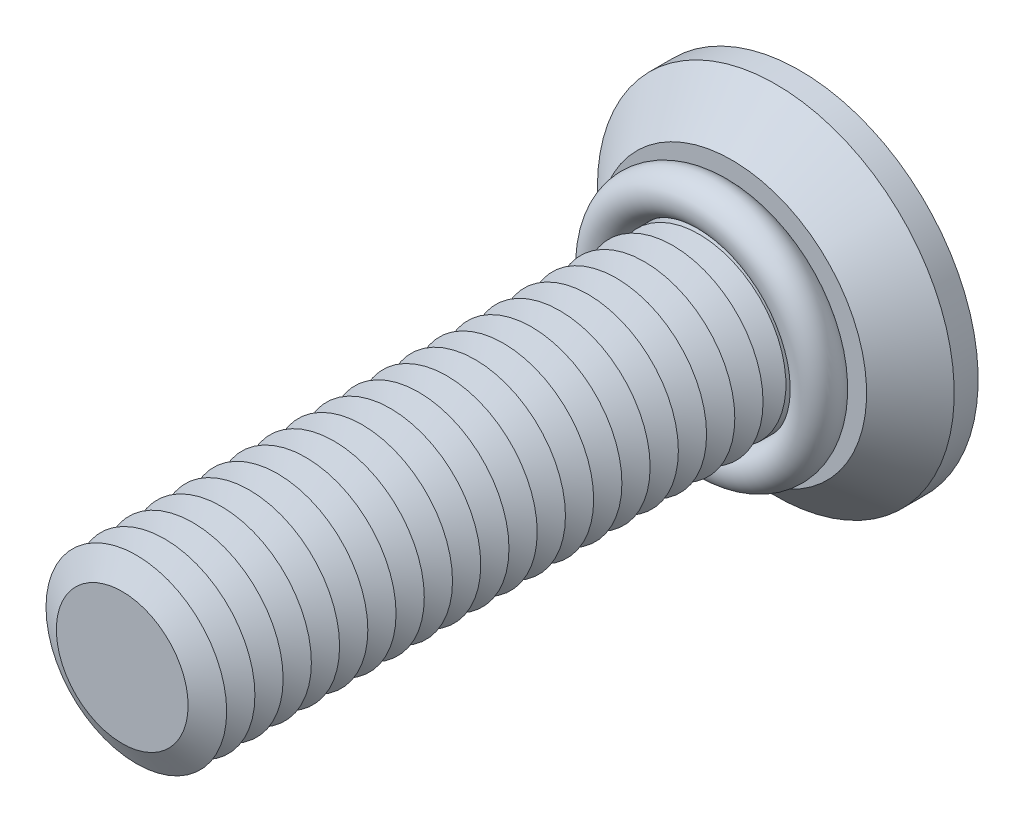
ISO-10303-21;
HEADER;
FILE_DESCRIPTION(('STEP AP214'),'2;1');
FILE_NAME('part.step','',(''),(''),'','','');
FILE_SCHEMA(('AUTOMOTIVE_DESIGN { 1 0 10303 214 1 1 1 1 }'));
ENDSEC;
DATA;
#1=APPLICATION_CONTEXT('core data for automotive mechanical design processes');
#2=APPLICATION_PROTOCOL_DEFINITION('international standard','automotive_design',2000,#1);
#3=PRODUCT_CONTEXT('',#1,'mechanical');
#4=PRODUCT('Part','Part','',(#3));
#5=PRODUCT_RELATED_PRODUCT_CATEGORY('part','',(#4));
#6=PRODUCT_DEFINITION_FORMATION('','',#4);
#7=PRODUCT_DEFINITION_CONTEXT('part definition',#1,'design');
#8=PRODUCT_DEFINITION('design','',#6,#7);
#9=PRODUCT_DEFINITION_SHAPE('','',#8);
#10=(LENGTH_UNIT() NAMED_UNIT(*) SI_UNIT(.MILLI.,.METRE.));
#11=(NAMED_UNIT(*) PLANE_ANGLE_UNIT() SI_UNIT($,.RADIAN.));
#12=(NAMED_UNIT(*) SI_UNIT($,.STERADIAN.) SOLID_ANGLE_UNIT());
#13=UNCERTAINTY_MEASURE_WITH_UNIT(LENGTH_MEASURE(1.E-05),#10,'distance_accuracy_value','');
#14=(GEOMETRIC_REPRESENTATION_CONTEXT(3) GLOBAL_UNCERTAINTY_ASSIGNED_CONTEXT((#13)) GLOBAL_UNIT_ASSIGNED_CONTEXT((#10,
#11,#12)) REPRESENTATION_CONTEXT('',''));
#15=CARTESIAN_POINT('',(0.,0.,0.));
#16=DIRECTION('',(0.,0.,1.));
#17=DIRECTION('',(1.,0.,0.));
#18=AXIS2_PLACEMENT_3D('',#15,#16,#17);
#19=CARTESIAN_POINT('',(0.,0.,3.9));
#20=DIRECTION('',(0.,0.,1.));
#21=DIRECTION('',(1.,0.,0.));
#22=AXIS2_PLACEMENT_3D('',#19,#20,#21);
#23=TOROIDAL_SURFACE('',#22,4.75,0.9);
#24=CARTESIAN_POINT('',(0.,4.75,3.9));
#25=DIRECTION('',(1.,0.,0.));
#26=DIRECTION('',(0.,0.,-1.));
#27=AXIS2_PLACEMENT_3D('',#24,#25,#26);
#28=CIRCLE('',#27,0.9);
#29=CARTESIAN_POINT('',(0.,5.65,3.9));
#30=VERTEX_POINT('',#29);
#31=EDGE_CURVE('P0_E10',#30,#30,#28,.T.);
#32=CARTESIAN_POINT('',(0.,0.,3.9));
#33=DIRECTION('',(0.,0.,1.));
#34=DIRECTION('',(1.,0.,0.));
#35=AXIS2_PLACEMENT_3D('',#32,#33,#34);
#36=CIRCLE('',#35,5.65);
#37=EDGE_CURVE('',#30,#30,#36,.T.);
#38=ORIENTED_EDGE('',*,*,#31,.F.);
#39=ORIENTED_EDGE('',*,*,#31,.T.);
#40=ORIENTED_EDGE('',*,*,#37,.T.);
#41=ORIENTED_EDGE('',*,*,#37,.F.);
#42=EDGE_LOOP('',(#38,#40,#39,#41));
#43=FACE_BOUND('',#42,.T.);
#44=ADVANCED_FACE('P0_F14',(#43),#23,.T.);
#45=CLOSED_SHELL('',(#44));
#46=MANIFOLD_SOLID_BREP('P0_B1',#45);
#47=CARTESIAN_POINT('',(0.,0.,23.75));
#48=DIRECTION('',(0.,0.,-1.));
#49=DIRECTION('',(-1.,0.,0.));
#50=AXIS2_PLACEMENT_3D('',#47,#48,#49);
#51=CONICAL_SURFACE('',#50,2.91746824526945,1.0471975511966);
#52=CARTESIAN_POINT('',(0.,0.,23.125));
#53=DIRECTION('',(0.,0.,1.));
#54=DIRECTION('',(1.,0.,0.));
#55=AXIS2_PLACEMENT_3D('',#52,#53,#54);
#56=CIRCLE('',#55,4.);
#57=CARTESIAN_POINT('',(4.,0.,23.125));
#58=VERTEX_POINT('',#57);
#59=EDGE_CURVE('P1_E324',#58,#58,#56,.T.);
#60=ORIENTED_EDGE('',*,*,#59,.T.);
#61=EDGE_LOOP('',(#60));
#62=FACE_BOUND('',#61,.T.);
#63=CARTESIAN_POINT('',(0.,0.,23.75));
#64=DIRECTION('',(0.,0.,1.));
#65=DIRECTION('',(1.,0.,0.));
#66=AXIS2_PLACEMENT_3D('',#63,#64,#65);
#67=CIRCLE('',#66,2.91746824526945);
#68=CARTESIAN_POINT('',(2.91746824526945,0.,23.75));
#69=VERTEX_POINT('',#68);
#70=EDGE_CURVE('P1_E321',#69,#69,#67,.T.);
#71=ORIENTED_EDGE('',*,*,#70,.F.);
#72=EDGE_LOOP('',(#71));
#73=FACE_BOUND('',#72,.T.);
#74=ADVANCED_FACE('P1_F15',(#62,#73),#51,.T.);
#75=CARTESIAN_POINT('',(0.,0.,24.375));
#76=DIRECTION('',(0.,0.,1.));
#77=DIRECTION('',(1.,0.,0.));
#78=AXIS2_PLACEMENT_3D('',#75,#76,#77);
#79=CONICAL_SURFACE('',#78,4.,1.0471975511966);
#80=ORIENTED_EDGE('',*,*,#70,.T.);
#81=EDGE_LOOP('',(#80));
#82=FACE_BOUND('',#81,.T.);
#83=CARTESIAN_POINT('',(0.,0.,24.375));
#84=DIRECTION('',(0.,0.,1.));
#85=DIRECTION('',(1.,0.,0.));
#86=AXIS2_PLACEMENT_3D('',#83,#84,#85);
#87=CIRCLE('',#86,4.);
#88=CARTESIAN_POINT('',(4.,0.,24.375));
#89=VERTEX_POINT('',#88);
#90=EDGE_CURVE('P1_E318',#89,#89,#87,.T.);
#91=ORIENTED_EDGE('',*,*,#90,.F.);
#92=EDGE_LOOP('',(#91));
#93=FACE_BOUND('',#92,.T.);
#94=ADVANCED_FACE('P1_F245',(#82,#93),#79,.T.);
#95=CARTESIAN_POINT('',(0.,0.,30.));
#96=DIRECTION('',(0.,0.,1.));
#97=DIRECTION('',(1.,0.,0.));
#98=AXIS2_PLACEMENT_3D('',#95,#96,#97);
#99=PLANE('',#98);
#100=CARTESIAN_POINT('',(0.,0.,30.));
#101=DIRECTION('',(0.,0.,1.));
#102=DIRECTION('',(1.,0.,0.));
#103=AXIS2_PLACEMENT_3D('',#100,#101,#102);
#104=CIRCLE('',#103,2.91746824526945);
#105=CARTESIAN_POINT('',(2.91746824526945,0.,30.));
#106=VERTEX_POINT('',#105);
#107=EDGE_CURVE('P1_E131',#106,#106,#104,.T.);
#108=ORIENTED_EDGE('',*,*,#107,.T.);
#109=EDGE_LOOP('',(#108));
#110=FACE_BOUND('',#109,.T.);
#111=ADVANCED_FACE('P1_F251',(#110),#99,.T.);
#112=CARTESIAN_POINT('',(0.,0.,30.));
#113=DIRECTION('',(0.,0.,-1.));
#114=DIRECTION('',(-1.,0.,0.));
#115=AXIS2_PLACEMENT_3D('',#112,#113,#114);
#116=CONICAL_SURFACE('',#115,2.91746824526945,1.0471975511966);
#117=CARTESIAN_POINT('',(0.,0.,29.375));
#118=DIRECTION('',(0.,0.,1.));
#119=DIRECTION('',(1.,0.,0.));
#120=AXIS2_PLACEMENT_3D('',#117,#118,#119);
#121=CIRCLE('',#120,4.);
#122=CARTESIAN_POINT('',(4.,0.,29.375));
#123=VERTEX_POINT('',#122);
#124=EDGE_CURVE('P1_E133',#123,#123,#121,.T.);
#125=ORIENTED_EDGE('',*,*,#124,.T.);
#126=EDGE_LOOP('',(#125));
#127=FACE_BOUND('',#126,.T.);
#128=ORIENTED_EDGE('',*,*,#107,.F.);
#129=EDGE_LOOP('',(#128));
#130=FACE_BOUND('',#129,.T.);
#131=ADVANCED_FACE('P1_F196',(#127,#130),#116,.T.);
#132=CARTESIAN_POINT('',(0.,0.,29.375));
#133=DIRECTION('',(0.,0.,1.));
#134=DIRECTION('',(1.,0.,0.));
#135=AXIS2_PLACEMENT_3D('',#132,#133,#134);
#136=CONICAL_SURFACE('',#135,4.,1.0471975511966);
#137=CARTESIAN_POINT('',(0.,0.,28.75));
#138=DIRECTION('',(0.,0.,1.));
#139=DIRECTION('',(1.,0.,0.));
#140=AXIS2_PLACEMENT_3D('',#137,#138,#139);
#141=CIRCLE('',#140,2.91746824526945);
#142=CARTESIAN_POINT('',(2.91746824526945,0.,28.75));
#143=VERTEX_POINT('',#142);
#144=EDGE_CURVE('P1_E297',#143,#143,#141,.T.);
#145=ORIENTED_EDGE('',*,*,#144,.T.);
#146=EDGE_LOOP('',(#145));
#147=FACE_BOUND('',#146,.T.);
#148=ORIENTED_EDGE('',*,*,#124,.F.);
#149=EDGE_LOOP('',(#148));
#150=FACE_BOUND('',#149,.T.);
#151=ADVANCED_FACE('P1_F284',(#147,#150),#136,.T.);
#152=CARTESIAN_POINT('',(0.,0.,28.75));
#153=DIRECTION('',(0.,0.,-1.));
#154=DIRECTION('',(-1.,0.,0.));
#155=AXIS2_PLACEMENT_3D('',#152,#153,#154);
#156=CONICAL_SURFACE('',#155,2.91746824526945,1.0471975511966);
#157=CARTESIAN_POINT('',(0.,0.,28.125));
#158=DIRECTION('',(0.,0.,1.));
#159=DIRECTION('',(1.,0.,0.));
#160=AXIS2_PLACEMENT_3D('',#157,#158,#159);
#161=CIRCLE('',#160,4.);
#162=CARTESIAN_POINT('',(4.,0.,28.125));
#163=VERTEX_POINT('',#162);
#164=EDGE_CURVE('P1_E294',#163,#163,#161,.T.);
#165=ORIENTED_EDGE('',*,*,#164,.T.);
#166=EDGE_LOOP('',(#165));
#167=FACE_BOUND('',#166,.T.);
#168=ORIENTED_EDGE('',*,*,#144,.F.);
#169=EDGE_LOOP('',(#168));
#170=FACE_BOUND('',#169,.T.);
#171=ADVANCED_FACE('P1_F279',(#167,#170),#156,.T.);
#172=CARTESIAN_POINT('',(0.,0.,28.125));
#173=DIRECTION('',(0.,0.,1.));
#174=DIRECTION('',(1.,0.,0.));
#175=AXIS2_PLACEMENT_3D('',#172,#173,#174);
#176=CONICAL_SURFACE('',#175,4.,1.0471975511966);
#177=CARTESIAN_POINT('',(0.,0.,27.5));
#178=DIRECTION('',(0.,0.,1.));
#179=DIRECTION('',(1.,0.,0.));
#180=AXIS2_PLACEMENT_3D('',#177,#178,#179);
#181=CIRCLE('',#180,2.91746824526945);
#182=CARTESIAN_POINT('',(2.91746824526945,0.,27.5));
#183=VERTEX_POINT('',#182);
#184=EDGE_CURVE('P1_E301',#183,#183,#181,.T.);
#185=ORIENTED_EDGE('',*,*,#184,.T.);
#186=EDGE_LOOP('',(#185));
#187=FACE_BOUND('',#186,.T.);
#188=ORIENTED_EDGE('',*,*,#164,.F.);
#189=EDGE_LOOP('',(#188));
#190=FACE_BOUND('',#189,.T.);
#191=ADVANCED_FACE('P1_F276',(#187,#190),#176,.T.);
#192=CARTESIAN_POINT('',(0.,0.,27.5));
#193=DIRECTION('',(0.,0.,-1.));
#194=DIRECTION('',(-1.,0.,0.));
#195=AXIS2_PLACEMENT_3D('',#192,#193,#194);
#196=CONICAL_SURFACE('',#195,2.91746824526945,1.0471975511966);
#197=CARTESIAN_POINT('',(0.,0.,26.875));
#198=DIRECTION('',(0.,0.,1.));
#199=DIRECTION('',(1.,0.,0.));
#200=AXIS2_PLACEMENT_3D('',#197,#198,#199);
#201=CIRCLE('',#200,4.);
#202=CARTESIAN_POINT('',(4.,0.,26.875));
#203=VERTEX_POINT('',#202);
#204=EDGE_CURVE('P1_E306',#203,#203,#201,.T.);
#205=ORIENTED_EDGE('',*,*,#204,.T.);
#206=EDGE_LOOP('',(#205));
#207=FACE_BOUND('',#206,.T.);
#208=ORIENTED_EDGE('',*,*,#184,.F.);
#209=EDGE_LOOP('',(#208));
#210=FACE_BOUND('',#209,.T.);
#211=ADVANCED_FACE('P1_F271',(#207,#210),#196,.T.);
#212=CARTESIAN_POINT('',(0.,0.,26.875));
#213=DIRECTION('',(0.,0.,1.));
#214=DIRECTION('',(1.,0.,0.));
#215=AXIS2_PLACEMENT_3D('',#212,#213,#214);
#216=CONICAL_SURFACE('',#215,4.,1.0471975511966);
#217=CARTESIAN_POINT('',(0.,0.,26.25));
#218=DIRECTION('',(0.,0.,1.));
#219=DIRECTION('',(1.,0.,0.));
#220=AXIS2_PLACEMENT_3D('',#217,#218,#219);
#221=CIRCLE('',#220,2.91746824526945);
#222=CARTESIAN_POINT('',(2.91746824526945,0.,26.25));
#223=VERTEX_POINT('',#222);
#224=EDGE_CURVE('P1_E309',#223,#223,#221,.T.);
#225=ORIENTED_EDGE('',*,*,#224,.T.);
#226=EDGE_LOOP('',(#225));
#227=FACE_BOUND('',#226,.T.);
#228=ORIENTED_EDGE('',*,*,#204,.F.);
#229=EDGE_LOOP('',(#228));
#230=FACE_BOUND('',#229,.T.);
#231=ADVANCED_FACE('P1_F268',(#227,#230),#216,.T.);
#232=CARTESIAN_POINT('',(0.,0.,26.25));
#233=DIRECTION('',(0.,0.,-1.));
#234=DIRECTION('',(-1.,0.,0.));
#235=AXIS2_PLACEMENT_3D('',#232,#233,#234);
#236=CONICAL_SURFACE('',#235,2.91746824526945,1.0471975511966);
#237=CARTESIAN_POINT('',(0.,0.,25.625));
#238=DIRECTION('',(0.,0.,1.));
#239=DIRECTION('',(1.,0.,0.));
#240=AXIS2_PLACEMENT_3D('',#237,#238,#239);
#241=CIRCLE('',#240,4.);
#242=CARTESIAN_POINT('',(4.,0.,25.625));
#243=VERTEX_POINT('',#242);
#244=EDGE_CURVE('P1_E312',#243,#243,#241,.T.);
#245=ORIENTED_EDGE('',*,*,#244,.T.);
#246=EDGE_LOOP('',(#245));
#247=FACE_BOUND('',#246,.T.);
#248=ORIENTED_EDGE('',*,*,#224,.F.);
#249=EDGE_LOOP('',(#248));
#250=FACE_BOUND('',#249,.T.);
#251=ADVANCED_FACE('P1_F262',(#247,#250),#236,.T.);
#252=CARTESIAN_POINT('',(0.,0.,25.625));
#253=DIRECTION('',(0.,0.,1.));
#254=DIRECTION('',(1.,0.,0.));
#255=AXIS2_PLACEMENT_3D('',#252,#253,#254);
#256=CONICAL_SURFACE('',#255,4.,1.0471975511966);
#257=CARTESIAN_POINT('',(0.,0.,25.));
#258=DIRECTION('',(0.,0.,1.));
#259=DIRECTION('',(1.,0.,0.));
#260=AXIS2_PLACEMENT_3D('',#257,#258,#259);
#261=CIRCLE('',#260,2.91746824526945);
#262=CARTESIAN_POINT('',(2.91746824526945,0.,25.));
#263=VERTEX_POINT('',#262);
#264=EDGE_CURVE('P1_E315',#263,#263,#261,.T.);
#265=ORIENTED_EDGE('',*,*,#264,.T.);
#266=EDGE_LOOP('',(#265));
#267=FACE_BOUND('',#266,.T.);
#268=ORIENTED_EDGE('',*,*,#244,.F.);
#269=EDGE_LOOP('',(#268));
#270=FACE_BOUND('',#269,.T.);
#271=ADVANCED_FACE('P1_F258',(#267,#270),#256,.T.);
#272=CARTESIAN_POINT('',(0.,0.,25.));
#273=DIRECTION('',(0.,0.,-1.));
#274=DIRECTION('',(-1.,0.,0.));
#275=AXIS2_PLACEMENT_3D('',#272,#273,#274);
#276=CONICAL_SURFACE('',#275,2.91746824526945,1.0471975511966);
#277=ORIENTED_EDGE('',*,*,#90,.T.);
#278=EDGE_LOOP('',(#277));
#279=FACE_BOUND('',#278,.T.);
#280=ORIENTED_EDGE('',*,*,#264,.F.);
#281=EDGE_LOOP('',(#280));
#282=FACE_BOUND('',#281,.T.);
#283=ADVANCED_FACE('P1_F261',(#279,#282),#276,.T.);
#284=CARTESIAN_POINT('',(0.,0.,22.5));
#285=DIRECTION('',(0.,0.,-1.));
#286=DIRECTION('',(-1.,0.,0.));
#287=AXIS2_PLACEMENT_3D('',#284,#285,#286);
#288=CONICAL_SURFACE('',#287,2.91746824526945,1.0471975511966);
#289=CARTESIAN_POINT('',(0.,0.,21.875));
#290=DIRECTION('',(0.,0.,1.));
#291=DIRECTION('',(1.,0.,0.));
#292=AXIS2_PLACEMENT_3D('',#289,#290,#291);
#293=CIRCLE('',#292,4.);
#294=CARTESIAN_POINT('',(4.,0.,21.875));
#295=VERTEX_POINT('',#294);
#296=EDGE_CURVE('P1_E329',#295,#295,#293,.T.);
#297=ORIENTED_EDGE('',*,*,#296,.T.);
#298=EDGE_LOOP('',(#297));
#299=FACE_BOUND('',#298,.T.);
#300=CARTESIAN_POINT('',(0.,0.,22.5));
#301=DIRECTION('',(0.,0.,1.));
#302=DIRECTION('',(1.,0.,0.));
#303=AXIS2_PLACEMENT_3D('',#300,#301,#302);
#304=CIRCLE('',#303,2.91746824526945);
#305=CARTESIAN_POINT('',(2.91746824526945,0.,22.5));
#306=VERTEX_POINT('',#305);
#307=EDGE_CURVE('P1_E326',#306,#306,#304,.T.);
#308=ORIENTED_EDGE('',*,*,#307,.F.);
#309=EDGE_LOOP('',(#308));
#310=FACE_BOUND('',#309,.T.);
#311=ADVANCED_FACE('P1_F266',(#299,#310),#288,.T.);
#312=CARTESIAN_POINT('',(0.,0.,23.125));
#313=DIRECTION('',(0.,0.,1.));
#314=DIRECTION('',(1.,0.,0.));
#315=AXIS2_PLACEMENT_3D('',#312,#313,#314);
#316=CONICAL_SURFACE('',#315,4.,1.0471975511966);
#317=ORIENTED_EDGE('',*,*,#307,.T.);
#318=EDGE_LOOP('',(#317));
#319=FACE_BOUND('',#318,.T.);
#320=ORIENTED_EDGE('',*,*,#59,.F.);
#321=EDGE_LOOP('',(#320));
#322=FACE_BOUND('',#321,.T.);
#323=ADVANCED_FACE('P1_F515',(#319,#322),#316,.T.);
#324=CARTESIAN_POINT('',(0.,0.,21.25));
#325=DIRECTION('',(0.,0.,-1.));
#326=DIRECTION('',(-1.,0.,0.));
#327=AXIS2_PLACEMENT_3D('',#324,#325,#326);
#328=CONICAL_SURFACE('',#327,2.91746824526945,1.0471975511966);
#329=CARTESIAN_POINT('',(0.,0.,20.625));
#330=DIRECTION('',(0.,0.,1.));
#331=DIRECTION('',(1.,0.,0.));
#332=AXIS2_PLACEMENT_3D('',#329,#330,#331);
#333=CIRCLE('',#332,4.);
#334=CARTESIAN_POINT('',(4.,0.,20.625));
#335=VERTEX_POINT('',#334);
#336=EDGE_CURVE('P1_E335',#335,#335,#333,.T.);
#337=ORIENTED_EDGE('',*,*,#336,.T.);
#338=EDGE_LOOP('',(#337));
#339=FACE_BOUND('',#338,.T.);
#340=CARTESIAN_POINT('',(0.,0.,21.25));
#341=DIRECTION('',(0.,0.,1.));
#342=DIRECTION('',(1.,0.,0.));
#343=AXIS2_PLACEMENT_3D('',#340,#341,#342);
#344=CIRCLE('',#343,2.91746824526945);
#345=CARTESIAN_POINT('',(2.91746824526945,0.,21.25));
#346=VERTEX_POINT('',#345);
#347=EDGE_CURVE('P1_E332',#346,#346,#344,.T.);
#348=ORIENTED_EDGE('',*,*,#347,.F.);
#349=EDGE_LOOP('',(#348));
#350=FACE_BOUND('',#349,.T.);
#351=ADVANCED_FACE('P1_F524',(#339,#350),#328,.T.);
#352=CARTESIAN_POINT('',(0.,0.,21.875));
#353=DIRECTION('',(0.,0.,1.));
#354=DIRECTION('',(1.,0.,0.));
#355=AXIS2_PLACEMENT_3D('',#352,#353,#354);
#356=CONICAL_SURFACE('',#355,4.,1.0471975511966);
#357=ORIENTED_EDGE('',*,*,#347,.T.);
#358=EDGE_LOOP('',(#357));
#359=FACE_BOUND('',#358,.T.);
#360=ORIENTED_EDGE('',*,*,#296,.F.);
#361=EDGE_LOOP('',(#360));
#362=FACE_BOUND('',#361,.T.);
#363=ADVANCED_FACE('P1_F534',(#359,#362),#356,.T.);
#364=CARTESIAN_POINT('',(0.,0.,20.));
#365=DIRECTION('',(0.,0.,-1.));
#366=DIRECTION('',(-1.,0.,0.));
#367=AXIS2_PLACEMENT_3D('',#364,#365,#366);
#368=CONICAL_SURFACE('',#367,2.91746824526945,1.0471975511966);
#369=CARTESIAN_POINT('',(0.,0.,19.375));
#370=DIRECTION('',(0.,0.,1.));
#371=DIRECTION('',(1.,0.,0.));
#372=AXIS2_PLACEMENT_3D('',#369,#370,#371);
#373=CIRCLE('',#372,4.);
#374=CARTESIAN_POINT('',(4.,0.,19.375));
#375=VERTEX_POINT('',#374);
#376=EDGE_CURVE('P1_E341',#375,#375,#373,.T.);
#377=ORIENTED_EDGE('',*,*,#376,.T.);
#378=EDGE_LOOP('',(#377));
#379=FACE_BOUND('',#378,.T.);
#380=CARTESIAN_POINT('',(0.,0.,20.));
#381=DIRECTION('',(0.,0.,1.));
#382=DIRECTION('',(1.,0.,0.));
#383=AXIS2_PLACEMENT_3D('',#380,#381,#382);
#384=CIRCLE('',#383,2.91746824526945);
#385=CARTESIAN_POINT('',(2.91746824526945,0.,20.));
#386=VERTEX_POINT('',#385);
#387=EDGE_CURVE('P1_E338',#386,#386,#384,.T.);
#388=ORIENTED_EDGE('',*,*,#387,.F.);
#389=EDGE_LOOP('',(#388));
#390=FACE_BOUND('',#389,.T.);
#391=ADVANCED_FACE('P1_F544',(#379,#390),#368,.T.);
#392=CARTESIAN_POINT('',(0.,0.,20.625));
#393=DIRECTION('',(0.,0.,1.));
#394=DIRECTION('',(1.,0.,0.));
#395=AXIS2_PLACEMENT_3D('',#392,#393,#394);
#396=CONICAL_SURFACE('',#395,4.,1.0471975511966);
#397=ORIENTED_EDGE('',*,*,#387,.T.);
#398=EDGE_LOOP('',(#397));
#399=FACE_BOUND('',#398,.T.);
#400=ORIENTED_EDGE('',*,*,#336,.F.);
#401=EDGE_LOOP('',(#400));
#402=FACE_BOUND('',#401,.T.);
#403=ADVANCED_FACE('P1_F554',(#399,#402),#396,.T.);
#404=CARTESIAN_POINT('',(0.,0.,18.75));
#405=DIRECTION('',(0.,0.,-1.));
#406=DIRECTION('',(-1.,0.,0.));
#407=AXIS2_PLACEMENT_3D('',#404,#405,#406);
#408=CONICAL_SURFACE('',#407,2.91746824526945,1.0471975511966);
#409=CARTESIAN_POINT('',(0.,0.,18.125));
#410=DIRECTION('',(0.,0.,1.));
#411=DIRECTION('',(1.,0.,0.));
#412=AXIS2_PLACEMENT_3D('',#409,#410,#411);
#413=CIRCLE('',#412,4.);
#414=CARTESIAN_POINT('',(4.,0.,18.125));
#415=VERTEX_POINT('',#414);
#416=EDGE_CURVE('P1_E347',#415,#415,#413,.T.);
#417=ORIENTED_EDGE('',*,*,#416,.T.);
#418=EDGE_LOOP('',(#417));
#419=FACE_BOUND('',#418,.T.);
#420=CARTESIAN_POINT('',(0.,0.,18.75));
#421=DIRECTION('',(0.,0.,1.));
#422=DIRECTION('',(1.,0.,0.));
#423=AXIS2_PLACEMENT_3D('',#420,#421,#422);
#424=CIRCLE('',#423,2.91746824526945);
#425=CARTESIAN_POINT('',(2.91746824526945,0.,18.75));
#426=VERTEX_POINT('',#425);
#427=EDGE_CURVE('P1_E344',#426,#426,#424,.T.);
#428=ORIENTED_EDGE('',*,*,#427,.F.);
#429=EDGE_LOOP('',(#428));
#430=FACE_BOUND('',#429,.T.);
#431=ADVANCED_FACE('P1_F564',(#419,#430),#408,.T.);
#432=CARTESIAN_POINT('',(0.,0.,19.375));
#433=DIRECTION('',(0.,0.,1.));
#434=DIRECTION('',(1.,0.,0.));
#435=AXIS2_PLACEMENT_3D('',#432,#433,#434);
#436=CONICAL_SURFACE('',#435,4.,1.0471975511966);
#437=ORIENTED_EDGE('',*,*,#427,.T.);
#438=EDGE_LOOP('',(#437));
#439=FACE_BOUND('',#438,.T.);
#440=ORIENTED_EDGE('',*,*,#376,.F.);
#441=EDGE_LOOP('',(#440));
#442=FACE_BOUND('',#441,.T.);
#443=ADVANCED_FACE('P1_F574',(#439,#442),#436,.T.);
#444=CARTESIAN_POINT('',(0.,0.,17.5));
#445=DIRECTION('',(0.,0.,-1.));
#446=DIRECTION('',(-1.,0.,0.));
#447=AXIS2_PLACEMENT_3D('',#444,#445,#446);
#448=CONICAL_SURFACE('',#447,2.91746824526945,1.0471975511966);
#449=CARTESIAN_POINT('',(0.,0.,16.875));
#450=DIRECTION('',(0.,0.,1.));
#451=DIRECTION('',(1.,0.,0.));
#452=AXIS2_PLACEMENT_3D('',#449,#450,#451);
#453=CIRCLE('',#452,4.);
#454=CARTESIAN_POINT('',(4.,0.,16.875));
#455=VERTEX_POINT('',#454);
#456=EDGE_CURVE('P1_E353',#455,#455,#453,.T.);
#457=ORIENTED_EDGE('',*,*,#456,.T.);
#458=EDGE_LOOP('',(#457));
#459=FACE_BOUND('',#458,.T.);
#460=CARTESIAN_POINT('',(0.,0.,17.5));
#461=DIRECTION('',(0.,0.,1.));
#462=DIRECTION('',(1.,0.,0.));
#463=AXIS2_PLACEMENT_3D('',#460,#461,#462);
#464=CIRCLE('',#463,2.91746824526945);
#465=CARTESIAN_POINT('',(2.91746824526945,0.,17.5));
#466=VERTEX_POINT('',#465);
#467=EDGE_CURVE('P1_E350',#466,#466,#464,.T.);
#468=ORIENTED_EDGE('',*,*,#467,.F.);
#469=EDGE_LOOP('',(#468));
#470=FACE_BOUND('',#469,.T.);
#471=ADVANCED_FACE('P1_F584',(#459,#470),#448,.T.);
#472=CARTESIAN_POINT('',(0.,0.,18.125));
#473=DIRECTION('',(0.,0.,1.));
#474=DIRECTION('',(1.,0.,0.));
#475=AXIS2_PLACEMENT_3D('',#472,#473,#474);
#476=CONICAL_SURFACE('',#475,4.,1.0471975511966);
#477=ORIENTED_EDGE('',*,*,#467,.T.);
#478=EDGE_LOOP('',(#477));
#479=FACE_BOUND('',#478,.T.);
#480=ORIENTED_EDGE('',*,*,#416,.F.);
#481=EDGE_LOOP('',(#480));
#482=FACE_BOUND('',#481,.T.);
#483=ADVANCED_FACE('P1_F594',(#479,#482),#476,.T.);
#484=CARTESIAN_POINT('',(0.,0.,16.25));
#485=DIRECTION('',(0.,0.,-1.));
#486=DIRECTION('',(-1.,0.,0.));
#487=AXIS2_PLACEMENT_3D('',#484,#485,#486);
#488=CONICAL_SURFACE('',#487,2.91746824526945,1.0471975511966);
#489=CARTESIAN_POINT('',(0.,0.,15.625));
#490=DIRECTION('',(0.,0.,1.));
#491=DIRECTION('',(1.,0.,0.));
#492=AXIS2_PLACEMENT_3D('',#489,#490,#491);
#493=CIRCLE('',#492,4.);
#494=CARTESIAN_POINT('',(4.,0.,15.625));
#495=VERTEX_POINT('',#494);
#496=EDGE_CURVE('P1_E359',#495,#495,#493,.T.);
#497=ORIENTED_EDGE('',*,*,#496,.T.);
#498=EDGE_LOOP('',(#497));
#499=FACE_BOUND('',#498,.T.);
#500=CARTESIAN_POINT('',(0.,0.,16.25));
#501=DIRECTION('',(0.,0.,1.));
#502=DIRECTION('',(1.,0.,0.));
#503=AXIS2_PLACEMENT_3D('',#500,#501,#502);
#504=CIRCLE('',#503,2.91746824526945);
#505=CARTESIAN_POINT('',(2.91746824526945,0.,16.25));
#506=VERTEX_POINT('',#505);
#507=EDGE_CURVE('P1_E356',#506,#506,#504,.T.);
#508=ORIENTED_EDGE('',*,*,#507,.F.);
#509=EDGE_LOOP('',(#508));
#510=FACE_BOUND('',#509,.T.);
#511=ADVANCED_FACE('P1_F604',(#499,#510),#488,.T.);
#512=CARTESIAN_POINT('',(0.,0.,16.875));
#513=DIRECTION('',(0.,0.,1.));
#514=DIRECTION('',(1.,0.,0.));
#515=AXIS2_PLACEMENT_3D('',#512,#513,#514);
#516=CONICAL_SURFACE('',#515,4.,1.0471975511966);
#517=ORIENTED_EDGE('',*,*,#507,.T.);
#518=EDGE_LOOP('',(#517));
#519=FACE_BOUND('',#518,.T.);
#520=ORIENTED_EDGE('',*,*,#456,.F.);
#521=EDGE_LOOP('',(#520));
#522=FACE_BOUND('',#521,.T.);
#523=ADVANCED_FACE('P1_F614',(#519,#522),#516,.T.);
#524=CARTESIAN_POINT('',(0.,0.,15.));
#525=DIRECTION('',(0.,0.,-1.));
#526=DIRECTION('',(-1.,0.,0.));
#527=AXIS2_PLACEMENT_3D('',#524,#525,#526);
#528=CONICAL_SURFACE('',#527,2.91746824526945,1.0471975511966);
#529=CARTESIAN_POINT('',(0.,0.,14.375));
#530=DIRECTION('',(0.,0.,1.));
#531=DIRECTION('',(1.,0.,0.));
#532=AXIS2_PLACEMENT_3D('',#529,#530,#531);
#533=CIRCLE('',#532,4.);
#534=CARTESIAN_POINT('',(4.,0.,14.375));
#535=VERTEX_POINT('',#534);
#536=EDGE_CURVE('P1_E365',#535,#535,#533,.T.);
#537=ORIENTED_EDGE('',*,*,#536,.T.);
#538=EDGE_LOOP('',(#537));
#539=FACE_BOUND('',#538,.T.);
#540=CARTESIAN_POINT('',(0.,0.,15.));
#541=DIRECTION('',(0.,0.,1.));
#542=DIRECTION('',(1.,0.,0.));
#543=AXIS2_PLACEMENT_3D('',#540,#541,#542);
#544=CIRCLE('',#543,2.91746824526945);
#545=CARTESIAN_POINT('',(2.91746824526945,0.,15.));
#546=VERTEX_POINT('',#545);
#547=EDGE_CURVE('P1_E362',#546,#546,#544,.T.);
#548=ORIENTED_EDGE('',*,*,#547,.F.);
#549=EDGE_LOOP('',(#548));
#550=FACE_BOUND('',#549,.T.);
#551=ADVANCED_FACE('P1_F624',(#539,#550),#528,.T.);
#552=CARTESIAN_POINT('',(0.,0.,15.625));
#553=DIRECTION('',(0.,0.,1.));
#554=DIRECTION('',(1.,0.,0.));
#555=AXIS2_PLACEMENT_3D('',#552,#553,#554);
#556=CONICAL_SURFACE('',#555,4.,1.0471975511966);
#557=ORIENTED_EDGE('',*,*,#547,.T.);
#558=EDGE_LOOP('',(#557));
#559=FACE_BOUND('',#558,.T.);
#560=ORIENTED_EDGE('',*,*,#496,.F.);
#561=EDGE_LOOP('',(#560));
#562=FACE_BOUND('',#561,.T.);
#563=ADVANCED_FACE('P1_F634',(#559,#562),#556,.T.);
#564=CARTESIAN_POINT('',(0.,0.,13.75));
#565=DIRECTION('',(0.,0.,-1.));
#566=DIRECTION('',(-1.,0.,0.));
#567=AXIS2_PLACEMENT_3D('',#564,#565,#566);
#568=CONICAL_SURFACE('',#567,2.91746824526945,1.0471975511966);
#569=CARTESIAN_POINT('',(0.,0.,13.125));
#570=DIRECTION('',(0.,0.,1.));
#571=DIRECTION('',(1.,0.,0.));
#572=AXIS2_PLACEMENT_3D('',#569,#570,#571);
#573=CIRCLE('',#572,4.);
#574=CARTESIAN_POINT('',(4.,0.,13.125));
#575=VERTEX_POINT('',#574);
#576=EDGE_CURVE('P1_E371',#575,#575,#573,.T.);
#577=ORIENTED_EDGE('',*,*,#576,.T.);
#578=EDGE_LOOP('',(#577));
#579=FACE_BOUND('',#578,.T.);
#580=CARTESIAN_POINT('',(0.,0.,13.75));
#581=DIRECTION('',(0.,0.,1.));
#582=DIRECTION('',(1.,0.,0.));
#583=AXIS2_PLACEMENT_3D('',#580,#581,#582);
#584=CIRCLE('',#583,2.91746824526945);
#585=CARTESIAN_POINT('',(2.91746824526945,0.,13.75));
#586=VERTEX_POINT('',#585);
#587=EDGE_CURVE('P1_E368',#586,#586,#584,.T.);
#588=ORIENTED_EDGE('',*,*,#587,.F.);
#589=EDGE_LOOP('',(#588));
#590=FACE_BOUND('',#589,.T.);
#591=ADVANCED_FACE('P1_F644',(#579,#590),#568,.T.);
#592=CARTESIAN_POINT('',(0.,0.,14.375));
#593=DIRECTION('',(0.,0.,1.));
#594=DIRECTION('',(1.,0.,0.));
#595=AXIS2_PLACEMENT_3D('',#592,#593,#594);
#596=CONICAL_SURFACE('',#595,4.,1.0471975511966);
#597=ORIENTED_EDGE('',*,*,#587,.T.);
#598=EDGE_LOOP('',(#597));
#599=FACE_BOUND('',#598,.T.);
#600=ORIENTED_EDGE('',*,*,#536,.F.);
#601=EDGE_LOOP('',(#600));
#602=FACE_BOUND('',#601,.T.);
#603=ADVANCED_FACE('P1_F654',(#599,#602),#596,.T.);
#604=CARTESIAN_POINT('',(0.,0.,12.5));
#605=DIRECTION('',(0.,0.,-1.));
#606=DIRECTION('',(-1.,0.,0.));
#607=AXIS2_PLACEMENT_3D('',#604,#605,#606);
#608=CONICAL_SURFACE('',#607,2.91746824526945,1.0471975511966);
#609=CARTESIAN_POINT('',(0.,0.,11.875));
#610=DIRECTION('',(0.,0.,1.));
#611=DIRECTION('',(1.,0.,0.));
#612=AXIS2_PLACEMENT_3D('',#609,#610,#611);
#613=CIRCLE('',#612,4.);
#614=CARTESIAN_POINT('',(4.,0.,11.875));
#615=VERTEX_POINT('',#614);
#616=EDGE_CURVE('P1_E377',#615,#615,#613,.T.);
#617=ORIENTED_EDGE('',*,*,#616,.T.);
#618=EDGE_LOOP('',(#617));
#619=FACE_BOUND('',#618,.T.);
#620=CARTESIAN_POINT('',(0.,0.,12.5));
#621=DIRECTION('',(0.,0.,1.));
#622=DIRECTION('',(1.,0.,0.));
#623=AXIS2_PLACEMENT_3D('',#620,#621,#622);
#624=CIRCLE('',#623,2.91746824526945);
#625=CARTESIAN_POINT('',(2.91746824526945,0.,12.5));
#626=VERTEX_POINT('',#625);
#627=EDGE_CURVE('P1_E374',#626,#626,#624,.T.);
#628=ORIENTED_EDGE('',*,*,#627,.F.);
#629=EDGE_LOOP('',(#628));
#630=FACE_BOUND('',#629,.T.);
#631=ADVANCED_FACE('P1_F664',(#619,#630),#608,.T.);
#632=CARTESIAN_POINT('',(0.,0.,13.125));
#633=DIRECTION('',(0.,0.,1.));
#634=DIRECTION('',(1.,0.,0.));
#635=AXIS2_PLACEMENT_3D('',#632,#633,#634);
#636=CONICAL_SURFACE('',#635,4.,1.0471975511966);
#637=ORIENTED_EDGE('',*,*,#627,.T.);
#638=EDGE_LOOP('',(#637));
#639=FACE_BOUND('',#638,.T.);
#640=ORIENTED_EDGE('',*,*,#576,.F.);
#641=EDGE_LOOP('',(#640));
#642=FACE_BOUND('',#641,.T.);
#643=ADVANCED_FACE('P1_F674',(#639,#642),#636,.T.);
#644=CARTESIAN_POINT('',(0.,0.,11.25));
#645=DIRECTION('',(0.,0.,-1.));
#646=DIRECTION('',(-1.,0.,0.));
#647=AXIS2_PLACEMENT_3D('',#644,#645,#646);
#648=CONICAL_SURFACE('',#647,2.91746824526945,1.0471975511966);
#649=CARTESIAN_POINT('',(0.,0.,10.625));
#650=DIRECTION('',(0.,0.,1.));
#651=DIRECTION('',(1.,0.,0.));
#652=AXIS2_PLACEMENT_3D('',#649,#650,#651);
#653=CIRCLE('',#652,4.);
#654=CARTESIAN_POINT('',(4.,0.,10.625));
#655=VERTEX_POINT('',#654);
#656=EDGE_CURVE('P1_E383',#655,#655,#653,.T.);
#657=ORIENTED_EDGE('',*,*,#656,.T.);
#658=EDGE_LOOP('',(#657));
#659=FACE_BOUND('',#658,.T.);
#660=CARTESIAN_POINT('',(0.,0.,11.25));
#661=DIRECTION('',(0.,0.,1.));
#662=DIRECTION('',(1.,0.,0.));
#663=AXIS2_PLACEMENT_3D('',#660,#661,#662);
#664=CIRCLE('',#663,2.91746824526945);
#665=CARTESIAN_POINT('',(2.91746824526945,0.,11.25));
#666=VERTEX_POINT('',#665);
#667=EDGE_CURVE('P1_E380',#666,#666,#664,.T.);
#668=ORIENTED_EDGE('',*,*,#667,.F.);
#669=EDGE_LOOP('',(#668));
#670=FACE_BOUND('',#669,.T.);
#671=ADVANCED_FACE('P1_F684',(#659,#670),#648,.T.);
#672=CARTESIAN_POINT('',(0.,0.,11.875));
#673=DIRECTION('',(0.,0.,1.));
#674=DIRECTION('',(1.,0.,0.));
#675=AXIS2_PLACEMENT_3D('',#672,#673,#674);
#676=CONICAL_SURFACE('',#675,4.,1.0471975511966);
#677=ORIENTED_EDGE('',*,*,#667,.T.);
#678=EDGE_LOOP('',(#677));
#679=FACE_BOUND('',#678,.T.);
#680=ORIENTED_EDGE('',*,*,#616,.F.);
#681=EDGE_LOOP('',(#680));
#682=FACE_BOUND('',#681,.T.);
#683=ADVANCED_FACE('P1_F694',(#679,#682),#676,.T.);
#684=CARTESIAN_POINT('',(0.,0.,10.));
#685=DIRECTION('',(0.,0.,-1.));
#686=DIRECTION('',(-1.,0.,0.));
#687=AXIS2_PLACEMENT_3D('',#684,#685,#686);
#688=CONICAL_SURFACE('',#687,2.91746824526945,1.0471975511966);
#689=CARTESIAN_POINT('',(0.,0.,9.375));
#690=DIRECTION('',(0.,0.,1.));
#691=DIRECTION('',(1.,0.,0.));
#692=AXIS2_PLACEMENT_3D('',#689,#690,#691);
#693=CIRCLE('',#692,4.);
#694=CARTESIAN_POINT('',(4.,0.,9.375));
#695=VERTEX_POINT('',#694);
#696=EDGE_CURVE('P1_E389',#695,#695,#693,.T.);
#697=ORIENTED_EDGE('',*,*,#696,.T.);
#698=EDGE_LOOP('',(#697));
#699=FACE_BOUND('',#698,.T.);
#700=CARTESIAN_POINT('',(0.,0.,10.));
#701=DIRECTION('',(0.,0.,1.));
#702=DIRECTION('',(1.,0.,0.));
#703=AXIS2_PLACEMENT_3D('',#700,#701,#702);
#704=CIRCLE('',#703,2.91746824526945);
#705=CARTESIAN_POINT('',(2.91746824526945,0.,10.));
#706=VERTEX_POINT('',#705);
#707=EDGE_CURVE('P1_E386',#706,#706,#704,.T.);
#708=ORIENTED_EDGE('',*,*,#707,.F.);
#709=EDGE_LOOP('',(#708));
#710=FACE_BOUND('',#709,.T.);
#711=ADVANCED_FACE('P1_F704',(#699,#710),#688,.T.);
#712=CARTESIAN_POINT('',(0.,0.,10.625));
#713=DIRECTION('',(0.,0.,1.));
#714=DIRECTION('',(1.,0.,0.));
#715=AXIS2_PLACEMENT_3D('',#712,#713,#714);
#716=CONICAL_SURFACE('',#715,4.,1.0471975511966);
#717=ORIENTED_EDGE('',*,*,#707,.T.);
#718=EDGE_LOOP('',(#717));
#719=FACE_BOUND('',#718,.T.);
#720=ORIENTED_EDGE('',*,*,#656,.F.);
#721=EDGE_LOOP('',(#720));
#722=FACE_BOUND('',#721,.T.);
#723=ADVANCED_FACE('P1_F714',(#719,#722),#716,.T.);
#724=CARTESIAN_POINT('',(0.,0.,8.75));
#725=DIRECTION('',(0.,0.,-1.));
#726=DIRECTION('',(-1.,0.,0.));
#727=AXIS2_PLACEMENT_3D('',#724,#725,#726);
#728=CONICAL_SURFACE('',#727,2.91746824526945,1.0471975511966);
#729=CARTESIAN_POINT('',(0.,0.,8.125));
#730=DIRECTION('',(0.,0.,1.));
#731=DIRECTION('',(1.,0.,0.));
#732=AXIS2_PLACEMENT_3D('',#729,#730,#731);
#733=CIRCLE('',#732,4.);
#734=CARTESIAN_POINT('',(4.,0.,8.125));
#735=VERTEX_POINT('',#734);
#736=EDGE_CURVE('P1_E395',#735,#735,#733,.T.);
#737=ORIENTED_EDGE('',*,*,#736,.T.);
#738=EDGE_LOOP('',(#737));
#739=FACE_BOUND('',#738,.T.);
#740=CARTESIAN_POINT('',(0.,0.,8.75));
#741=DIRECTION('',(0.,0.,1.));
#742=DIRECTION('',(1.,0.,0.));
#743=AXIS2_PLACEMENT_3D('',#740,#741,#742);
#744=CIRCLE('',#743,2.91746824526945);
#745=CARTESIAN_POINT('',(2.91746824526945,0.,8.75));
#746=VERTEX_POINT('',#745);
#747=EDGE_CURVE('P1_E392',#746,#746,#744,.T.);
#748=ORIENTED_EDGE('',*,*,#747,.F.);
#749=EDGE_LOOP('',(#748));
#750=FACE_BOUND('',#749,.T.);
#751=ADVANCED_FACE('P1_F724',(#739,#750),#728,.T.);
#752=CARTESIAN_POINT('',(0.,0.,9.375));
#753=DIRECTION('',(0.,0.,1.));
#754=DIRECTION('',(1.,0.,0.));
#755=AXIS2_PLACEMENT_3D('',#752,#753,#754);
#756=CONICAL_SURFACE('',#755,4.,1.0471975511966);
#757=ORIENTED_EDGE('',*,*,#747,.T.);
#758=EDGE_LOOP('',(#757));
#759=FACE_BOUND('',#758,.T.);
#760=ORIENTED_EDGE('',*,*,#696,.F.);
#761=EDGE_LOOP('',(#760));
#762=FACE_BOUND('',#761,.T.);
#763=ADVANCED_FACE('P1_F734',(#759,#762),#756,.T.);
#764=CARTESIAN_POINT('',(0.,0.,7.5));
#765=DIRECTION('',(0.,0.,-1.));
#766=DIRECTION('',(-1.,0.,0.));
#767=AXIS2_PLACEMENT_3D('',#764,#765,#766);
#768=CONICAL_SURFACE('',#767,2.91746824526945,1.0471975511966);
#769=CARTESIAN_POINT('',(0.,0.,6.875));
#770=DIRECTION('',(0.,0.,1.));
#771=DIRECTION('',(1.,0.,0.));
#772=AXIS2_PLACEMENT_3D('',#769,#770,#771);
#773=CIRCLE('',#772,4.);
#774=CARTESIAN_POINT('',(4.,0.,6.875));
#775=VERTEX_POINT('',#774);
#776=EDGE_CURVE('P1_E401',#775,#775,#773,.T.);
#777=ORIENTED_EDGE('',*,*,#776,.T.);
#778=EDGE_LOOP('',(#777));
#779=FACE_BOUND('',#778,.T.);
#780=CARTESIAN_POINT('',(0.,0.,7.5));
#781=DIRECTION('',(0.,0.,1.));
#782=DIRECTION('',(1.,0.,0.));
#783=AXIS2_PLACEMENT_3D('',#780,#781,#782);
#784=CIRCLE('',#783,2.91746824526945);
#785=CARTESIAN_POINT('',(2.91746824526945,0.,7.5));
#786=VERTEX_POINT('',#785);
#787=EDGE_CURVE('P1_E398',#786,#786,#784,.T.);
#788=ORIENTED_EDGE('',*,*,#787,.F.);
#789=EDGE_LOOP('',(#788));
#790=FACE_BOUND('',#789,.T.);
#791=ADVANCED_FACE('P1_F744',(#779,#790),#768,.T.);
#792=CARTESIAN_POINT('',(0.,0.,8.125));
#793=DIRECTION('',(0.,0.,1.));
#794=DIRECTION('',(1.,0.,0.));
#795=AXIS2_PLACEMENT_3D('',#792,#793,#794);
#796=CONICAL_SURFACE('',#795,4.,1.0471975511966);
#797=ORIENTED_EDGE('',*,*,#787,.T.);
#798=EDGE_LOOP('',(#797));
#799=FACE_BOUND('',#798,.T.);
#800=ORIENTED_EDGE('',*,*,#736,.F.);
#801=EDGE_LOOP('',(#800));
#802=FACE_BOUND('',#801,.T.);
#803=ADVANCED_FACE('P1_F754',(#799,#802),#796,.T.);
#804=CARTESIAN_POINT('',(0.,0.,6.25));
#805=DIRECTION('',(0.,0.,-1.));
#806=DIRECTION('',(-1.,0.,0.));
#807=AXIS2_PLACEMENT_3D('',#804,#805,#806);
#808=CONICAL_SURFACE('',#807,2.91746824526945,1.0471975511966);
#809=CARTESIAN_POINT('',(0.,0.,5.625));
#810=DIRECTION('',(0.,0.,1.));
#811=DIRECTION('',(1.,0.,0.));
#812=AXIS2_PLACEMENT_3D('',#809,#810,#811);
#813=CIRCLE('',#812,4.);
#814=CARTESIAN_POINT('',(4.,0.,5.625));
#815=VERTEX_POINT('',#814);
#816=EDGE_CURVE('P1_E407',#815,#815,#813,.T.);
#817=ORIENTED_EDGE('',*,*,#816,.T.);
#818=EDGE_LOOP('',(#817));
#819=FACE_BOUND('',#818,.T.);
#820=CARTESIAN_POINT('',(0.,0.,6.25));
#821=DIRECTION('',(0.,0.,1.));
#822=DIRECTION('',(1.,0.,0.));
#823=AXIS2_PLACEMENT_3D('',#820,#821,#822);
#824=CIRCLE('',#823,2.91746824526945);
#825=CARTESIAN_POINT('',(2.91746824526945,0.,6.25));
#826=VERTEX_POINT('',#825);
#827=EDGE_CURVE('P1_E404',#826,#826,#824,.T.);
#828=ORIENTED_EDGE('',*,*,#827,.F.);
#829=EDGE_LOOP('',(#828));
#830=FACE_BOUND('',#829,.T.);
#831=ADVANCED_FACE('P1_F764',(#819,#830),#808,.T.);
#832=CARTESIAN_POINT('',(0.,0.,6.875));
#833=DIRECTION('',(0.,0.,1.));
#834=DIRECTION('',(1.,0.,0.));
#835=AXIS2_PLACEMENT_3D('',#832,#833,#834);
#836=CONICAL_SURFACE('',#835,4.,1.0471975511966);
#837=ORIENTED_EDGE('',*,*,#827,.T.);
#838=EDGE_LOOP('',(#837));
#839=FACE_BOUND('',#838,.T.);
#840=ORIENTED_EDGE('',*,*,#776,.F.);
#841=EDGE_LOOP('',(#840));
#842=FACE_BOUND('',#841,.T.);
#843=ADVANCED_FACE('P1_F420',(#839,#842),#836,.T.);
#844=CARTESIAN_POINT('',(0.,0.,5.));
#845=DIRECTION('',(0.,0.,-1.));
#846=DIRECTION('',(-1.,0.,0.));
#847=AXIS2_PLACEMENT_3D('',#844,#845,#846);
#848=CONICAL_SURFACE('',#847,2.91746824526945,1.0471975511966);
#849=CARTESIAN_POINT('',(0.,0.,5.));
#850=DIRECTION('',(0.,0.,1.));
#851=DIRECTION('',(1.,0.,0.));
#852=AXIS2_PLACEMENT_3D('',#849,#850,#851);
#853=CIRCLE('',#852,2.91746824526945);
#854=CARTESIAN_POINT('',(2.91746824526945,0.,5.));
#855=VERTEX_POINT('',#854);
#856=EDGE_CURVE('P1_E410',#855,#855,#853,.T.);
#857=ORIENTED_EDGE('',*,*,#856,.F.);
#858=EDGE_LOOP('',(#857));
#859=FACE_BOUND('',#858,.T.);
#860=CARTESIAN_POINT('',(0.,0.,4.46160254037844));
#861=DIRECTION('',(0.,0.,-1.));
#862=DIRECTION('',(-1.,0.,0.));
#863=AXIS2_PLACEMENT_3D('',#860,#861,#862);
#864=CIRCLE('',#863,3.85);
#865=CARTESIAN_POINT('',(-3.85,0.,4.46160254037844));
#866=VERTEX_POINT('',#865);
#867=EDGE_CURVE('P1_E19',#866,#866,#864,.F.);
#868=ORIENTED_EDGE('',*,*,#867,.T.);
#869=EDGE_LOOP('',(#868));
#870=FACE_BOUND('',#869,.T.);
#871=ADVANCED_FACE('P1_F417',(#859,#870),#848,.T.);
#872=CARTESIAN_POINT('',(0.,0.,5.625));
#873=DIRECTION('',(0.,0.,1.));
#874=DIRECTION('',(1.,0.,0.));
#875=AXIS2_PLACEMENT_3D('',#872,#873,#874);
#876=CONICAL_SURFACE('',#875,4.,1.0471975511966);
#877=ORIENTED_EDGE('',*,*,#856,.T.);
#878=EDGE_LOOP('',(#877));
#879=FACE_BOUND('',#878,.T.);
#880=ORIENTED_EDGE('',*,*,#816,.F.);
#881=EDGE_LOOP('',(#880));
#882=FACE_BOUND('',#881,.T.);
#883=ADVANCED_FACE('P1_F414',(#879,#882),#876,.T.);
#884=CARTESIAN_POINT('',(0.,0.,3.));
#885=DIRECTION('',(0.,0.,-1.));
#886=DIRECTION('',(-1.,0.,0.));
#887=AXIS2_PLACEMENT_3D('',#884,#885,#886);
#888=CONICAL_SURFACE('',#887,2.5,1.0471975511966);
#889=CARTESIAN_POINT('',(0.,0.,4.44337567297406));
#890=VERTEX_POINT('',#889);
#891=VERTEX_LOOP('',#890);
#892=FACE_BOUND('',#891,.T.);
#893=CARTESIAN_POINT('',(0.,0.,3.));
#894=DIRECTION('',(0.,0.,-1.));
#895=DIRECTION('',(-1.,0.,0.));
#896=AXIS2_PLACEMENT_3D('',#893,#894,#895);
#897=CIRCLE('',#896,2.5);
#898=CARTESIAN_POINT('',(-2.5,0.,3.));
#899=VERTEX_POINT('',#898);
#900=CARTESIAN_POINT('',(-1.25,2.1650635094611,3.));
#901=VERTEX_POINT('',#900);
#902=EDGE_CURVE('P1_E117',#899,#901,#897,.T.);
#903=ORIENTED_EDGE('',*,*,#902,.T.);
#904=CARTESIAN_POINT('',(0.,0.,3.));
#905=DIRECTION('',(0.,0.,-1.));
#906=DIRECTION('',(-1.,0.,0.));
#907=AXIS2_PLACEMENT_3D('',#904,#905,#906);
#908=CIRCLE('',#907,2.5);
#909=CARTESIAN_POINT('',(1.25,2.1650635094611,3.));
#910=VERTEX_POINT('',#909);
#911=EDGE_CURVE('P1_E24',#901,#910,#908,.T.);
#912=ORIENTED_EDGE('',*,*,#911,.T.);
#913=CARTESIAN_POINT('',(2.5,0.,3.));
#914=VERTEX_POINT('',#913);
#915=EDGE_CURVE('P1_E999',#910,#914,#908,.T.);
#916=ORIENTED_EDGE('',*,*,#915,.T.);
#917=CARTESIAN_POINT('',(1.25,-2.1650635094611,3.));
#918=VERTEX_POINT('',#917);
#919=EDGE_CURVE('P1_E992',#914,#918,#908,.T.);
#920=ORIENTED_EDGE('',*,*,#919,.T.);
#921=CARTESIAN_POINT('',(-1.25,-2.1650635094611,3.));
#922=VERTEX_POINT('',#921);
#923=EDGE_CURVE('P1_E182',#918,#922,#908,.T.);
#924=ORIENTED_EDGE('',*,*,#923,.T.);
#925=EDGE_CURVE('P1_E179',#922,#899,#908,.T.);
#926=ORIENTED_EDGE('',*,*,#925,.T.);
#927=EDGE_LOOP('',(#903,#912,#916,#920,#924,#926));
#928=FACE_BOUND('',#927,.T.);
#929=ADVANCED_FACE('P1_F198',(#892,#928),#888,.F.);
#930=CARTESIAN_POINT('',(0.,0.,3.));
#931=DIRECTION('',(0.,0.,-1.));
#932=DIRECTION('',(-1.,0.,0.));
#933=AXIS2_PLACEMENT_3D('',#930,#931,#932);
#934=PLANE('',#933);
#935=ORIENTED_EDGE('',*,*,#923,.F.);
#936=DIRECTION('',(-0.866025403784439,-0.5,0.));
#937=VECTOR('',#936,1.);
#938=CARTESIAN_POINT('',(2.5,-1.44337567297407,3.));
#939=LINE('',#938,#937);
#940=CARTESIAN_POINT('',(0.,-2.88675134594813,3.));
#941=VERTEX_POINT('',#940);
#942=EDGE_CURVE('P1_E1008',#918,#941,#939,.T.);
#943=ORIENTED_EDGE('',*,*,#942,.T.);
#944=DIRECTION('',(-0.866025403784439,0.5,0.));
#945=VECTOR('',#944,1.);
#946=CARTESIAN_POINT('',(0.,-2.88675134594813,3.));
#947=LINE('',#946,#945);
#948=EDGE_CURVE('P1_E1015',#941,#922,#947,.T.);
#949=ORIENTED_EDGE('',*,*,#948,.T.);
#950=EDGE_LOOP('',(#935,#943,#949));
#951=FACE_BOUND('',#950,.T.);
#952=ADVANCED_FACE('P1_F806',(#951),#934,.T.);
#953=ORIENTED_EDGE('',*,*,#925,.F.);
#954=CARTESIAN_POINT('',(-2.5,-1.44337567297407,3.));
#955=VERTEX_POINT('',#954);
#956=EDGE_CURVE('P1_E1018',#922,#955,#947,.T.);
#957=ORIENTED_EDGE('',*,*,#956,.T.);
#958=DIRECTION('',(0.,1.,0.));
#959=VECTOR('',#958,1.);
#960=CARTESIAN_POINT('',(-2.5,-1.44337567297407,3.));
#961=LINE('',#960,#959);
#962=EDGE_CURVE('P1_E123',#955,#899,#961,.T.);
#963=ORIENTED_EDGE('',*,*,#962,.T.);
#964=EDGE_LOOP('',(#953,#957,#963));
#965=FACE_BOUND('',#964,.T.);
#966=ADVANCED_FACE('P1_F231',(#965),#934,.T.);
#967=ORIENTED_EDGE('',*,*,#902,.F.);
#968=CARTESIAN_POINT('',(-2.5,1.44337567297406,3.));
#969=VERTEX_POINT('',#968);
#970=EDGE_CURVE('P1_E1020',#899,#969,#961,.T.);
#971=ORIENTED_EDGE('',*,*,#970,.T.);
#972=DIRECTION('',(0.866025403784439,0.5,0.));
#973=VECTOR('',#972,1.);
#974=CARTESIAN_POINT('',(-2.5,1.44337567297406,3.));
#975=LINE('',#974,#973);
#976=EDGE_CURVE('P1_E1023',#969,#901,#975,.T.);
#977=ORIENTED_EDGE('',*,*,#976,.T.);
#978=EDGE_LOOP('',(#967,#971,#977));
#979=FACE_BOUND('',#978,.T.);
#980=ADVANCED_FACE('P1_F823',(#979),#934,.T.);
#981=ORIENTED_EDGE('',*,*,#911,.F.);
#982=CARTESIAN_POINT('',(0.,2.88675134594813,3.));
#983=VERTEX_POINT('',#982);
#984=EDGE_CURVE('P1_E1022',#901,#983,#975,.T.);
#985=ORIENTED_EDGE('',*,*,#984,.T.);
#986=DIRECTION('',(0.866025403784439,-0.5,0.));
#987=VECTOR('',#986,1.);
#988=CARTESIAN_POINT('',(0.,2.88675134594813,3.));
#989=LINE('',#988,#987);
#990=EDGE_CURVE('P1_E161',#983,#910,#989,.T.);
#991=ORIENTED_EDGE('',*,*,#990,.T.);
#992=EDGE_LOOP('',(#981,#985,#991));
#993=FACE_BOUND('',#992,.T.);
#994=ADVANCED_FACE('P1_F832',(#993),#934,.T.);
#995=ORIENTED_EDGE('',*,*,#915,.F.);
#996=CARTESIAN_POINT('',(2.5,1.44337567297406,3.));
#997=VERTEX_POINT('',#996);
#998=EDGE_CURVE('P1_E1007',#910,#997,#989,.T.);
#999=ORIENTED_EDGE('',*,*,#998,.T.);
#1000=DIRECTION('',(0.,-1.,0.));
#1001=VECTOR('',#1000,1.);
#1002=CARTESIAN_POINT('',(2.5,1.44337567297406,3.));
#1003=LINE('',#1002,#1001);
#1004=EDGE_CURVE('P1_E1002',#997,#914,#1003,.T.);
#1005=ORIENTED_EDGE('',*,*,#1004,.T.);
#1006=EDGE_LOOP('',(#995,#999,#1005));
#1007=FACE_BOUND('',#1006,.T.);
#1008=ADVANCED_FACE('P1_F841',(#1007),#934,.T.);
#1009=ORIENTED_EDGE('',*,*,#919,.F.);
#1010=CARTESIAN_POINT('',(2.5,-1.44337567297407,3.));
#1011=VERTEX_POINT('',#1010);
#1012=EDGE_CURVE('P1_E994',#914,#1011,#1003,.T.);
#1013=ORIENTED_EDGE('',*,*,#1012,.T.);
#1014=EDGE_CURVE('P1_E125',#1011,#918,#939,.T.);
#1015=ORIENTED_EDGE('',*,*,#1014,.T.);
#1016=EDGE_LOOP('',(#1009,#1013,#1015));
#1017=FACE_BOUND('',#1016,.T.);
#1018=ADVANCED_FACE('P1_F229',(#1017),#934,.T.);
#1019=CARTESIAN_POINT('',(2.5,-1.44337567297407,3.));
#1020=DIRECTION('',(0.5,-0.866025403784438,0.));
#1021=DIRECTION('',(0.866025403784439,0.5,0.));
#1022=AXIS2_PLACEMENT_3D('',#1019,#1020,#1021);
#1023=PLANE('',#1022);
#1024=DIRECTION('',(0.,0.,-1.));
#1025=VECTOR('',#1024,1.);
#1026=CARTESIAN_POINT('',(2.5,-1.44337567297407,3.));
#1027=LINE('',#1026,#1025);
#1028=CARTESIAN_POINT('',(2.5,-1.44337567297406,0.));
#1029=VERTEX_POINT('',#1028);
#1030=EDGE_CURVE('P1_E164',#1011,#1029,#1027,.T.);
#1031=ORIENTED_EDGE('',*,*,#1030,.T.);
#1032=CARTESIAN_POINT('',(2.5002,-1.44326020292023,-3.09419640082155E-05));
#1033=CARTESIAN_POINT('',(2.3963647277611,-1.50320952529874,0.016040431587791));
#1034=CARTESIAN_POINT('',(2.29234116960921,-1.56326755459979,0.0306306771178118));
#1035=CARTESIAN_POINT('',(2.08392662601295,-1.68359574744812,0.0562644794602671));
#1036=CARTESIAN_POINT('',(1.97953550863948,-1.74386598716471,0.0673065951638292));
#1037=CARTESIAN_POINT('',(1.77101887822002,-1.86425311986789,0.0851994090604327));
#1038=CARTESIAN_POINT('',(1.66689477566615,-1.9243691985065,0.0920714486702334));
#1039=CARTESIAN_POINT('',(1.45851376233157,-2.04467803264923,0.101286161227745));
#1040=CARTESIAN_POINT('',(1.35425688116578,-2.10487077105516,0.103629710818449));
#1041=CARTESIAN_POINT('',(1.14574311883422,-2.22525624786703,0.103629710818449));
#1042=CARTESIAN_POINT('',(1.04148623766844,-2.28544898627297,0.101286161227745));
#1043=CARTESIAN_POINT('',(0.833105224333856,-2.4057578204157,0.0920714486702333));
#1044=CARTESIAN_POINT('',(0.728981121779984,-2.4658738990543,0.0851994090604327));
#1045=CARTESIAN_POINT('',(0.520464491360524,-2.58626103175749,0.0673065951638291));
#1046=CARTESIAN_POINT('',(0.416073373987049,-2.64653127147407,0.056264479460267));
#1047=CARTESIAN_POINT('',(0.207658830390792,-2.7668594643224,0.0306306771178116));
#1048=CARTESIAN_POINT('',(0.103635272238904,-2.82691749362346,0.0160404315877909));
#1049=CARTESIAN_POINT('',(-0.000199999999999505,-2.88686681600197,-3.09419640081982E-05));
#1050=B_SPLINE_CURVE_WITH_KNOTS('',3,(#1032,#1033,#1034,#1035,#1036,#1037,#1038,#1039,#1040,
#1041,#1042,#1043,#1044,#1045,#1046,#1047,#1048,#1049),.UNSPECIFIED.,.F.,.F.,(4,2,2,2,2,2,2,2,
4),(0.,0.362931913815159,0.726011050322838,1.08721601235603,1.44835104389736,1.80948607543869,
2.17069103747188,2.53377017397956,2.89670208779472),.UNSPECIFIED.);
#1051=CARTESIAN_POINT('',(0.,-2.88675134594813,0.));
#1052=VERTEX_POINT('',#1051);
#1053=EDGE_CURVE('P1_E118',#1029,#1052,#1050,.T.);
#1054=ORIENTED_EDGE('',*,*,#1053,.T.);
#1055=DIRECTION('',(0.,0.,-1.));
#1056=VECTOR('',#1055,1.);
#1057=CARTESIAN_POINT('',(0.,-2.88675134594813,3.));
#1058=LINE('',#1057,#1056);
#1059=EDGE_CURVE('P1_E116',#941,#1052,#1058,.T.);
#1060=ORIENTED_EDGE('',*,*,#1059,.F.);
#1061=ORIENTED_EDGE('',*,*,#942,.F.);
#1062=ORIENTED_EDGE('',*,*,#1014,.F.);
#1063=EDGE_LOOP('',(#1031,#1054,#1060,#1061,#1062));
#1064=FACE_BOUND('',#1063,.T.);
#1065=ADVANCED_FACE('P1_F226',(#1064),#1023,.F.);
#1066=CARTESIAN_POINT('',(0.,-2.88675134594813,3.));
#1067=DIRECTION('',(-0.5,-0.866025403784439,0.));
#1068=DIRECTION('',(0.866025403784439,-0.5,0.));
#1069=AXIS2_PLACEMENT_3D('',#1066,#1067,#1068);
#1070=PLANE('',#1069);
#1071=ORIENTED_EDGE('',*,*,#1059,.T.);
#1072=CARTESIAN_POINT('',(0.000200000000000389,-2.88686681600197,-3.09419640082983E-05));
#1073=CARTESIAN_POINT('',(-0.103635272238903,-2.82691749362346,0.0160404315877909));
#1074=CARTESIAN_POINT('',(-0.207658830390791,-2.7668594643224,0.0306306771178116));
#1075=CARTESIAN_POINT('',(-0.416073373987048,-2.64653127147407,0.056264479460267));
#1076=CARTESIAN_POINT('',(-0.520464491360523,-2.58626103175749,0.0673065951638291));
#1077=CARTESIAN_POINT('',(-0.728981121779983,-2.4658738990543,0.0851994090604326));
#1078=CARTESIAN_POINT('',(-0.833105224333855,-2.4057578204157,0.0920714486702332));
#1079=CARTESIAN_POINT('',(-1.04148623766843,-2.28544898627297,0.101286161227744));
#1080=CARTESIAN_POINT('',(-1.14574311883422,-2.22525624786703,0.103629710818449));
#1081=CARTESIAN_POINT('',(-1.35425688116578,-2.10487077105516,0.103629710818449));
#1082=CARTESIAN_POINT('',(-1.45851376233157,-2.04467803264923,0.101286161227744));
#1083=CARTESIAN_POINT('',(-1.66689477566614,-1.9243691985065,0.0920714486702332));
#1084=CARTESIAN_POINT('',(-1.77101887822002,-1.8642531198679,0.0851994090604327));
#1085=CARTESIAN_POINT('',(-1.97953550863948,-1.74386598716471,0.0673065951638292));
#1086=CARTESIAN_POINT('',(-2.08392662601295,-1.68359574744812,0.0562644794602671));
#1087=CARTESIAN_POINT('',(-2.29234116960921,-1.56326755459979,0.0306306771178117));
#1088=CARTESIAN_POINT('',(-2.3963647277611,-1.50320952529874,0.016040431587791));
#1089=CARTESIAN_POINT('',(-2.5002,-1.44326020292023,-3.09419640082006E-05));
#1090=B_SPLINE_CURVE_WITH_KNOTS('',3,(#1072,#1073,#1074,#1075,#1076,#1077,#1078,#1079,#1080,
#1081,#1082,#1083,#1084,#1085,#1086,#1087,#1088,#1089),.UNSPECIFIED.,.F.,.F.,(4,2,2,2,2,2,2,2,
4),(0.,0.362931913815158,0.726011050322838,1.08721601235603,1.44835104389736,1.80948607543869,
2.17069103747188,2.53377017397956,2.89670208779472),.UNSPECIFIED.);
#1091=CARTESIAN_POINT('',(-2.5,-1.44337567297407,0.));
#1092=VERTEX_POINT('',#1091);
#1093=EDGE_CURVE('P1_E94',#1052,#1092,#1090,.T.);
#1094=ORIENTED_EDGE('',*,*,#1093,.T.);
#1095=DIRECTION('',(0.,0.,-1.));
#1096=VECTOR('',#1095,1.);
#1097=CARTESIAN_POINT('',(-2.5,-1.44337567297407,3.));
#1098=LINE('',#1097,#1096);
#1099=EDGE_CURVE('P1_E112',#955,#1092,#1098,.T.);
#1100=ORIENTED_EDGE('',*,*,#1099,.F.);
#1101=ORIENTED_EDGE('',*,*,#956,.F.);
#1102=ORIENTED_EDGE('',*,*,#948,.F.);
#1103=EDGE_LOOP('',(#1071,#1094,#1100,#1101,#1102));
#1104=FACE_BOUND('',#1103,.T.);
#1105=ADVANCED_FACE('P1_F110',(#1104),#1070,.F.);
#1106=CARTESIAN_POINT('',(-2.5,-1.44337567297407,3.));
#1107=DIRECTION('',(-1.,0.,0.));
#1108=DIRECTION('',(0.,-1.,0.));
#1109=AXIS2_PLACEMENT_3D('',#1106,#1107,#1108);
#1110=PLANE('',#1109);
#1111=ORIENTED_EDGE('',*,*,#1099,.T.);
#1112=CARTESIAN_POINT('',(-2.5,-3.76800948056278,-0.438146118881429));
#1113=CARTESIAN_POINT('',(-2.5,-3.65512241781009,-0.412947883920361));
#1114=CARTESIAN_POINT('',(-2.5,-3.54216337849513,-0.38806689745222));
#1115=CARTESIAN_POINT('',(-2.5,-3.31606595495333,-0.339109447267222));
#1116=CARTESIAN_POINT('',(-2.5,-3.202927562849,-0.315033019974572));
#1117=CARTESIAN_POINT('',(-2.5,-2.97632910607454,-0.26783262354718));
#1118=CARTESIAN_POINT('',(-2.5,-2.86286882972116,-0.244709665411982));
#1119=CARTESIAN_POINT('',(-2.5,-2.63570880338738,-0.199678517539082));
#1120=CARTESIAN_POINT('',(-2.5,-2.52200905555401,-0.177770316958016));
#1121=CARTESIAN_POINT('',(-2.5,-2.18246936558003,-0.114640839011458));
#1122=CARTESIAN_POINT('',(-2.5,-1.95621666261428,-0.0755946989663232));
#1123=CARTESIAN_POINT('',(-2.5,-1.50233128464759,-0.00642421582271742));
#1124=CARTESIAN_POINT('',(-2.5,-1.27469889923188,0.0237019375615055));
#1125=CARTESIAN_POINT('',(-2.5,-0.930935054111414,0.0592624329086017));
#1126=CARTESIAN_POINT('',(-2.5,-0.815306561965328,0.0695411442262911));
#1127=CARTESIAN_POINT('',(-2.5,-0.583775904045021,0.0862573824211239));
#1128=CARTESIAN_POINT('',(-2.5,-0.467873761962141,0.0926952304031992));
#1129=CARTESIAN_POINT('',(-2.5,-0.235955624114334,0.101355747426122));
#1130=CARTESIAN_POINT('',(-2.5,-0.119939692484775,0.103580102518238));
#1131=CARTESIAN_POINT('',(-2.5,0.112094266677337,0.103677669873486));
#1132=CARTESIAN_POINT('',(-2.5,0.228112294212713,0.101550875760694));
#1133=CARTESIAN_POINT('',(-2.5,0.460464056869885,0.0930637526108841));
#1134=CARTESIAN_POINT('',(-2.5,0.576797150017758,0.0866861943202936));
#1135=CARTESIAN_POINT('',(-2.5,0.809186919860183,0.070053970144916));
#1136=CARTESIAN_POINT('',(-2.5,0.925243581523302,0.0597990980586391));
#1137=CARTESIAN_POINT('',(-2.5,1.15707831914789,0.0359190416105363));
#1138=CARTESIAN_POINT('',(-2.5,1.27285617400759,0.0222917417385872));
#1139=CARTESIAN_POINT('',(-2.5,1.50403978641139,-0.0077859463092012));
#1140=CARTESIAN_POINT('',(-2.5,1.61944554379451,-0.0242363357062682));
#1141=CARTESIAN_POINT('',(-2.5,1.97116037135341,-0.0779484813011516));
#1142=CARTESIAN_POINT('',(-2.5,2.20690405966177,-0.118894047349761));
#1143=CARTESIAN_POINT('',(-2.5,2.67723558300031,-0.206964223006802));
#1144=CARTESIAN_POINT('',(-2.5,2.9118232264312,-0.254089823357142));
#1145=CARTESIAN_POINT('',(-2.5,3.38022088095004,-0.352353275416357));
#1146=CARTESIAN_POINT('',(-2.5,3.61403064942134,-0.40349227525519));
#1147=CARTESIAN_POINT('',(-2.5,4.08105387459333,-0.508428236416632));
#1148=CARTESIAN_POINT('',(-2.5,4.31426731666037,-0.562225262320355));
#1149=CARTESIAN_POINT('',(-2.5,4.77742011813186,-0.670976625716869));
#1150=CARTESIAN_POINT('',(-2.5,5.00736469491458,-0.725908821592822));
#1151=CARTESIAN_POINT('',(-2.5,5.46695141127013,-0.837043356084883));
#1152=CARTESIAN_POINT('',(-2.5,5.69659354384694,-0.893245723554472));
#1153=CARTESIAN_POINT('',(-2.5,6.15532898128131,-1.00649703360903));
#1154=CARTESIAN_POINT('',(-2.5,6.38442260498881,-1.06354468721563));
#1155=CARTESIAN_POINT('',(-2.5,6.84242442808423,-1.17834514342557));
#1156=CARTESIAN_POINT('',(-2.5,7.07133263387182,-1.23609792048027));
#1157=CARTESIAN_POINT('',(-2.5,7.30017784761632,-1.29409642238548));
#1158=B_SPLINE_CURVE_WITH_KNOTS('',3,(#1112,#1113,#1114,#1115,#1116,#1117,#1118,#1119,#1120,
#1121,#1122,#1123,#1124,#1125,#1126,#1127,#1128,#1129,#1130,#1131,#1132,#1133,#1134,#1135,#1136,
#1137,#1138,#1139,#1140,#1141,#1142,#1143,#1144,#1145,#1146,#1147,#1148,#1149,#1150,#1151,#1152,
#1153,#1154,#1155,#1156,#1157),.UNSPECIFIED.,.F.,.F.,(4,2,2,2,2,2,2,2,2,2,2,2,2,2,2,2,2,2,2,2,2,
2,4),(0.,0.346996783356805,0.69400925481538,1.04138068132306,1.38874900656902,2.07743762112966,
2.76598637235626,3.11418615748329,3.46235682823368,3.81038814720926,4.15841997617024,
4.50787110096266,4.85734081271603,5.20703030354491,5.55671994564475,6.27438533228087,
6.99216591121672,7.71015258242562,8.4281567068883,9.13739674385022,9.84665290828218,
10.5549206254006,11.2631627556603),.UNSPECIFIED.);
#1159=CARTESIAN_POINT('',(-2.5,1.44337567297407,0.));
#1160=VERTEX_POINT('',#1159);
#1161=EDGE_CURVE('P1_E10',#1092,#1160,#1158,.T.);
#1162=ORIENTED_EDGE('',*,*,#1161,.T.);
#1163=DIRECTION('',(0.,0.,-1.));
#1164=VECTOR('',#1163,1.);
#1165=CARTESIAN_POINT('',(-2.5,1.44337567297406,3.));
#1166=LINE('',#1165,#1164);
#1167=EDGE_CURVE('P1_E124',#969,#1160,#1166,.T.);
#1168=ORIENTED_EDGE('',*,*,#1167,.F.);
#1169=ORIENTED_EDGE('',*,*,#970,.F.);
#1170=ORIENTED_EDGE('',*,*,#962,.F.);
#1171=EDGE_LOOP('',(#1111,#1162,#1168,#1169,#1170));
#1172=FACE_BOUND('',#1171,.T.);
#1173=ADVANCED_FACE('P1_F120',(#1172),#1110,.F.);
#1174=CARTESIAN_POINT('',(-2.5,1.44337567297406,3.));
#1175=DIRECTION('',(-0.5,0.866025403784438,0.));
#1176=DIRECTION('',(-0.866025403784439,-0.5,0.));
#1177=AXIS2_PLACEMENT_3D('',#1174,#1175,#1176);
#1178=PLANE('',#1177);
#1179=ORIENTED_EDGE('',*,*,#1167,.T.);
#1180=CARTESIAN_POINT('',(-2.5002,1.44326020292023,-3.09419640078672E-05));
#1181=CARTESIAN_POINT('',(-2.3963647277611,1.50320952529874,0.0160404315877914));
#1182=CARTESIAN_POINT('',(-2.29234116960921,1.56326755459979,0.0306306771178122));
#1183=CARTESIAN_POINT('',(-2.08392662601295,1.68359574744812,0.0562644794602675));
#1184=CARTESIAN_POINT('',(-1.97953550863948,1.7438659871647,0.0673065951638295));
#1185=CARTESIAN_POINT('',(-1.77101887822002,1.86425311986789,0.0851994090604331));
#1186=CARTESIAN_POINT('',(-1.66689477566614,1.9243691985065,0.0920714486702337));
#1187=CARTESIAN_POINT('',(-1.45851376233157,2.04467803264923,0.101286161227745));
#1188=CARTESIAN_POINT('',(-1.35425688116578,2.10487077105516,0.10362971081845));
#1189=CARTESIAN_POINT('',(-1.14574311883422,2.22525624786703,0.10362971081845));
#1190=CARTESIAN_POINT('',(-1.04148623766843,2.28544898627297,0.101286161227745));
#1191=CARTESIAN_POINT('',(-0.833105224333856,2.40575782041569,0.0920714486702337));
#1192=CARTESIAN_POINT('',(-0.728981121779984,2.4658738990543,0.085199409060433));
#1193=CARTESIAN_POINT('',(-0.520464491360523,2.58626103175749,0.0673065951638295));
#1194=CARTESIAN_POINT('',(-0.416073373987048,2.64653127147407,0.0562644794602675));
#1195=CARTESIAN_POINT('',(-0.207658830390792,2.7668594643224,0.0306306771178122));
#1196=CARTESIAN_POINT('',(-0.103635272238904,2.82691749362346,0.0160404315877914));
#1197=CARTESIAN_POINT('',(0.000199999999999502,2.88686681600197,-3.09419640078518E-05));
#1198=B_SPLINE_CURVE_WITH_KNOTS('',3,(#1180,#1181,#1182,#1183,#1184,#1185,#1186,#1187,#1188,
#1189,#1190,#1191,#1192,#1193,#1194,#1195,#1196,#1197),.UNSPECIFIED.,.F.,.F.,(4,2,2,2,2,2,2,2,
4),(0.,0.362931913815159,0.726011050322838,1.08721601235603,1.44835104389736,1.80948607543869,
2.17069103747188,2.53377017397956,2.89670208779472),.UNSPECIFIED.);
#1199=CARTESIAN_POINT('',(0.,2.88675134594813,0.));
#1200=VERTEX_POINT('',#1199);
#1201=EDGE_CURVE('P1_E136',#1160,#1200,#1198,.T.);
#1202=ORIENTED_EDGE('',*,*,#1201,.T.);
#1203=DIRECTION('',(0.,0.,-1.));
#1204=VECTOR('',#1203,1.);
#1205=CARTESIAN_POINT('',(0.,2.88675134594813,3.));
#1206=LINE('',#1205,#1204);
#1207=EDGE_CURVE('P1_E155',#983,#1200,#1206,.T.);
#1208=ORIENTED_EDGE('',*,*,#1207,.F.);
#1209=ORIENTED_EDGE('',*,*,#984,.F.);
#1210=ORIENTED_EDGE('',*,*,#976,.F.);
#1211=EDGE_LOOP('',(#1179,#1202,#1208,#1209,#1210));
#1212=FACE_BOUND('',#1211,.T.);
#1213=ADVANCED_FACE('P1_F153',(#1212),#1178,.F.);
#1214=CARTESIAN_POINT('',(0.,2.88675134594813,3.));
#1215=DIRECTION('',(0.5,0.866025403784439,0.));
#1216=DIRECTION('',(-0.866025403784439,0.5,0.));
#1217=AXIS2_PLACEMENT_3D('',#1214,#1215,#1216);
#1218=PLANE('',#1217);
#1219=ORIENTED_EDGE('',*,*,#1207,.T.);
#1220=CARTESIAN_POINT('',(-0.000200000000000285,2.88686681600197,-3.09419640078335E-05));
#1221=CARTESIAN_POINT('',(0.103635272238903,2.82691749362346,0.0160404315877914));
#1222=CARTESIAN_POINT('',(0.207658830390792,2.7668594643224,0.0306306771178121));
#1223=CARTESIAN_POINT('',(0.416073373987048,2.64653127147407,0.0562644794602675));
#1224=CARTESIAN_POINT('',(0.520464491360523,2.58626103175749,0.0673065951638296));
#1225=CARTESIAN_POINT('',(0.728981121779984,2.4658738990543,0.0851994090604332));
#1226=CARTESIAN_POINT('',(0.833105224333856,2.40575782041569,0.0920714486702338));
#1227=CARTESIAN_POINT('',(1.04148623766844,2.28544898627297,0.101286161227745));
#1228=CARTESIAN_POINT('',(1.14574311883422,2.22525624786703,0.10362971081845));
#1229=CARTESIAN_POINT('',(1.35425688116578,2.10487077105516,0.10362971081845));
#1230=CARTESIAN_POINT('',(1.45851376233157,2.04467803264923,0.101286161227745));
#1231=CARTESIAN_POINT('',(1.66689477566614,1.9243691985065,0.0920714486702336));
#1232=CARTESIAN_POINT('',(1.77101887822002,1.86425311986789,0.085199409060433));
#1233=CARTESIAN_POINT('',(1.97953550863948,1.7438659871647,0.0673065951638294));
#1234=CARTESIAN_POINT('',(2.08392662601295,1.68359574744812,0.0562644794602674));
#1235=CARTESIAN_POINT('',(2.29234116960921,1.56326755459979,0.030630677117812));
#1236=CARTESIAN_POINT('',(2.3963647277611,1.50320952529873,0.0160404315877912));
#1237=CARTESIAN_POINT('',(2.5002,1.44326020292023,-3.09419640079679E-05));
#1238=B_SPLINE_CURVE_WITH_KNOTS('',3,(#1220,#1221,#1222,#1223,#1224,#1225,#1226,#1227,#1228,
#1229,#1230,#1231,#1232,#1233,#1234,#1235,#1236,#1237),.UNSPECIFIED.,.F.,.F.,(4,2,2,2,2,2,2,2,
4),(0.,0.362931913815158,0.726011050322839,1.08721601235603,1.44835104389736,1.80948607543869,
2.17069103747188,2.53377017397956,2.89670208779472),.UNSPECIFIED.);
#1239=CARTESIAN_POINT('',(2.5,1.44337567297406,0.));
#1240=VERTEX_POINT('',#1239);
#1241=EDGE_CURVE('P1_E141',#1200,#1240,#1238,.T.);
#1242=ORIENTED_EDGE('',*,*,#1241,.T.);
#1243=DIRECTION('',(0.,0.,-1.));
#1244=VECTOR('',#1243,1.);
#1245=CARTESIAN_POINT('',(2.5,1.44337567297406,3.));
#1246=LINE('',#1245,#1244);
#1247=EDGE_CURVE('P1_E162',#997,#1240,#1246,.T.);
#1248=ORIENTED_EDGE('',*,*,#1247,.F.);
#1249=ORIENTED_EDGE('',*,*,#998,.F.);
#1250=ORIENTED_EDGE('',*,*,#990,.F.);
#1251=EDGE_LOOP('',(#1219,#1242,#1248,#1249,#1250));
#1252=FACE_BOUND('',#1251,.T.);
#1253=ADVANCED_FACE('P1_F158',(#1252),#1218,.F.);
#1254=CARTESIAN_POINT('',(2.5,1.44337567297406,3.));
#1255=DIRECTION('',(1.,0.,0.));
#1256=DIRECTION('',(0.,0.,-1.));
#1257=AXIS2_PLACEMENT_3D('',#1254,#1255,#1256);
#1258=PLANE('',#1257);
#1259=ORIENTED_EDGE('',*,*,#1247,.T.);
#1260=CARTESIAN_POINT('',(2.5,-3.76800948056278,-0.438146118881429));
#1261=CARTESIAN_POINT('',(2.5,-3.65512241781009,-0.412947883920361));
#1262=CARTESIAN_POINT('',(2.5,-3.54216337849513,-0.38806689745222));
#1263=CARTESIAN_POINT('',(2.5,-3.31606595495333,-0.339109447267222));
#1264=CARTESIAN_POINT('',(2.5,-3.202927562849,-0.315033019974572));
#1265=CARTESIAN_POINT('',(2.5,-2.97632910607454,-0.26783262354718));
#1266=CARTESIAN_POINT('',(2.5,-2.86286882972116,-0.244709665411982));
#1267=CARTESIAN_POINT('',(2.5,-2.63570880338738,-0.199678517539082));
#1268=CARTESIAN_POINT('',(2.5,-2.52200905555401,-0.177770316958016));
#1269=CARTESIAN_POINT('',(2.5,-2.18246936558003,-0.114640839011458));
#1270=CARTESIAN_POINT('',(2.5,-1.95621666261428,-0.0755946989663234));
#1271=CARTESIAN_POINT('',(2.5,-1.50233128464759,-0.00642421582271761));
#1272=CARTESIAN_POINT('',(2.5,-1.27469889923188,0.0237019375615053));
#1273=CARTESIAN_POINT('',(2.5,-0.930935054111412,0.0592624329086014));
#1274=CARTESIAN_POINT('',(2.5,-0.815306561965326,0.0695411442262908));
#1275=CARTESIAN_POINT('',(2.5,-0.58377590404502,0.0862573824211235));
#1276=CARTESIAN_POINT('',(2.5,-0.467873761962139,0.0926952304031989));
#1277=CARTESIAN_POINT('',(2.5,-0.235955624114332,0.101355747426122));
#1278=CARTESIAN_POINT('',(2.5,-0.119939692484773,0.103580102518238));
#1279=CARTESIAN_POINT('',(2.5,0.112094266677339,0.103677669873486));
#1280=CARTESIAN_POINT('',(2.5,0.228112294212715,0.101550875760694));
#1281=CARTESIAN_POINT('',(2.5,0.460464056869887,0.0930637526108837));
#1282=CARTESIAN_POINT('',(2.5,0.57679715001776,0.0866861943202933));
#1283=CARTESIAN_POINT('',(2.5,0.809186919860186,0.0700539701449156));
#1284=CARTESIAN_POINT('',(2.5,0.925243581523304,0.0597990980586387));
#1285=CARTESIAN_POINT('',(2.5,1.1570783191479,0.0359190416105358));
#1286=CARTESIAN_POINT('',(2.5,1.27285617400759,0.0222917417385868));
#1287=CARTESIAN_POINT('',(2.5,1.50403978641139,-0.00778594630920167));
#1288=CARTESIAN_POINT('',(2.5,1.61944554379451,-0.0242363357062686));
#1289=CARTESIAN_POINT('',(2.5,1.97116037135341,-0.077948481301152));
#1290=CARTESIAN_POINT('',(2.5,2.20690405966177,-0.118894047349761));
#1291=CARTESIAN_POINT('',(2.5,2.67723558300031,-0.206964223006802));
#1292=CARTESIAN_POINT('',(2.5,2.9118232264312,-0.254089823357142));
#1293=CARTESIAN_POINT('',(2.5,3.38022088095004,-0.352353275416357));
#1294=CARTESIAN_POINT('',(2.5,3.61403064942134,-0.40349227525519));
#1295=CARTESIAN_POINT('',(2.5,4.08105387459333,-0.508428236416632));
#1296=CARTESIAN_POINT('',(2.5,4.31426731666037,-0.562225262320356));
#1297=CARTESIAN_POINT('',(2.5,4.77742011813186,-0.670976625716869));
#1298=CARTESIAN_POINT('',(2.5,5.00736469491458,-0.725908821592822));
#1299=CARTESIAN_POINT('',(2.5,5.46695141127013,-0.837043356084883));
#1300=CARTESIAN_POINT('',(2.5,5.69659354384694,-0.893245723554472));
#1301=CARTESIAN_POINT('',(2.5,6.15532898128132,-1.00649703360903));
#1302=CARTESIAN_POINT('',(2.5,6.38442260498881,-1.06354468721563));
#1303=CARTESIAN_POINT('',(2.5,6.84242442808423,-1.17834514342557));
#1304=CARTESIAN_POINT('',(2.5,7.07133263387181,-1.23609792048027));
#1305=CARTESIAN_POINT('',(2.5,7.30017784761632,-1.29409642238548));
#1306=B_SPLINE_CURVE_WITH_KNOTS('',3,(#1260,#1261,#1262,#1263,#1264,#1265,#1266,#1267,#1268,
#1269,#1270,#1271,#1272,#1273,#1274,#1275,#1276,#1277,#1278,#1279,#1280,#1281,#1282,#1283,#1284,
#1285,#1286,#1287,#1288,#1289,#1290,#1291,#1292,#1293,#1294,#1295,#1296,#1297,#1298,#1299,#1300,
#1301,#1302,#1303,#1304,#1305),.UNSPECIFIED.,.F.,.F.,(4,2,2,2,2,2,2,2,2,2,2,2,2,2,2,2,2,2,2,2,2,
2,4),(0.,0.346996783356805,0.69400925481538,1.04138068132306,1.38874900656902,2.07743762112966,
2.76598637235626,3.11418615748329,3.46235682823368,3.81038814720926,4.15841997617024,
4.50787110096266,4.85734081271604,5.20703030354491,5.55671994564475,6.27438533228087,
6.99216591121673,7.71015258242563,8.4281567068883,9.13739674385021,9.84665290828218,
10.5549206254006,11.2631627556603),.UNSPECIFIED.);
#1307=EDGE_CURVE('P1_E149',#1240,#1029,#1306,.F.);
#1308=ORIENTED_EDGE('',*,*,#1307,.T.);
#1309=ORIENTED_EDGE('',*,*,#1030,.F.);
#1310=ORIENTED_EDGE('',*,*,#1012,.F.);
#1311=ORIENTED_EDGE('',*,*,#1004,.F.);
#1312=EDGE_LOOP('',(#1259,#1308,#1309,#1310,#1311));
#1313=FACE_BOUND('',#1312,.T.);
#1314=ADVANCED_FACE('P1_F232',(#1313),#1258,.F.);
#1315=CARTESIAN_POINT('',(0.,0.,0.));
#1316=DIRECTION('',(0.,0.,-1.));
#1317=DIRECTION('',(-1.,0.,0.));
#1318=AXIS2_PLACEMENT_3D('',#1315,#1316,#1317);
#1319=CONICAL_SURFACE('',#1318,2.88675134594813,1.30899693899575);
#1320=CARTESIAN_POINT('',(0.,0.,0.));
#1321=DIRECTION('',(0.,0.,-1.));
#1322=DIRECTION('',(-1.,0.,0.));
#1323=AXIS2_PLACEMENT_3D('',#1320,#1321,#1322);
#1324=CIRCLE('',#1323,2.88675134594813);
#1325=EDGE_CURVE('P1_E30',#1029,#1052,#1324,.T.);
#1326=ORIENTED_EDGE('',*,*,#1325,.T.);
#1327=ORIENTED_EDGE('',*,*,#1053,.F.);
#1328=EDGE_LOOP('',(#1326,#1327));
#1329=FACE_BOUND('',#1328,.T.);
#1330=ADVANCED_FACE('P1_F195',(#1329),#1319,.F.);
#1331=EDGE_CURVE('P1_E90',#1052,#1092,#1324,.T.);
#1332=ORIENTED_EDGE('',*,*,#1331,.T.);
#1333=ORIENTED_EDGE('',*,*,#1093,.F.);
#1334=EDGE_LOOP('',(#1332,#1333));
#1335=FACE_BOUND('',#1334,.T.);
#1336=ADVANCED_FACE('P1_F92',(#1335),#1319,.F.);
#1337=EDGE_CURVE('P1_E98',#1092,#1160,#1324,.T.);
#1338=ORIENTED_EDGE('',*,*,#1337,.T.);
#1339=ORIENTED_EDGE('',*,*,#1161,.F.);
#1340=EDGE_LOOP('',(#1338,#1339));
#1341=FACE_BOUND('',#1340,.T.);
#1342=ADVANCED_FACE('P1_F102',(#1341),#1319,.F.);
#1343=EDGE_CURVE('P1_E130',#1160,#1200,#1324,.T.);
#1344=ORIENTED_EDGE('',*,*,#1343,.T.);
#1345=ORIENTED_EDGE('',*,*,#1201,.F.);
#1346=EDGE_LOOP('',(#1344,#1345));
#1347=FACE_BOUND('',#1346,.T.);
#1348=ADVANCED_FACE('P1_F915',(#1347),#1319,.F.);
#1349=EDGE_CURVE('P1_E137',#1200,#1240,#1324,.T.);
#1350=ORIENTED_EDGE('',*,*,#1349,.T.);
#1351=ORIENTED_EDGE('',*,*,#1241,.F.);
#1352=EDGE_LOOP('',(#1350,#1351));
#1353=FACE_BOUND('',#1352,.T.);
#1354=ADVANCED_FACE('P1_F144',(#1353),#1319,.F.);
#1355=EDGE_CURVE('P1_E37',#1240,#1029,#1324,.T.);
#1356=ORIENTED_EDGE('',*,*,#1355,.T.);
#1357=ORIENTED_EDGE('',*,*,#1307,.F.);
#1358=EDGE_LOOP('',(#1356,#1357));
#1359=FACE_BOUND('',#1358,.T.);
#1360=ADVANCED_FACE('P1_F901',(#1359),#1319,.F.);
#1361=CARTESIAN_POINT('',(0.,0.,0.));
#1362=DIRECTION('',(0.,0.,1.));
#1363=DIRECTION('',(1.,0.,0.));
#1364=AXIS2_PLACEMENT_3D('',#1361,#1362,#1363);
#1365=PLANE('',#1364);
#1366=ORIENTED_EDGE('',*,*,#1355,.F.);
#1367=ORIENTED_EDGE('',*,*,#1349,.F.);
#1368=ORIENTED_EDGE('',*,*,#1343,.F.);
#1369=ORIENTED_EDGE('',*,*,#1337,.F.);
#1370=ORIENTED_EDGE('',*,*,#1331,.F.);
#1371=ORIENTED_EDGE('',*,*,#1325,.F.);
#1372=EDGE_LOOP('',(#1366,#1367,#1368,#1369,#1370,#1371));
#1373=FACE_BOUND('',#1372,.T.);
#1374=CARTESIAN_POINT('',(0.,0.,0.));
#1375=DIRECTION('',(0.,0.,-1.));
#1376=DIRECTION('',(-1.,0.,0.));
#1377=AXIS2_PLACEMENT_3D('',#1374,#1375,#1376);
#1378=CIRCLE('',#1377,7.9);
#1379=CARTESIAN_POINT('',(-7.9,0.,0.));
#1380=VERTEX_POINT('',#1379);
#1381=EDGE_CURVE('P1_E169',#1380,#1380,#1378,.T.);
#1382=ORIENTED_EDGE('',*,*,#1381,.T.);
#1383=EDGE_LOOP('',(#1382));
#1384=FACE_BOUND('',#1383,.T.);
#1385=ADVANCED_FACE('P1_F17',(#1373,#1384),#1365,.F.);
#1386=CARTESIAN_POINT('',(0.,0.,30.));
#1387=DIRECTION('',(0.,0.,-1.));
#1388=DIRECTION('',(-1.,0.,0.));
#1389=AXIS2_PLACEMENT_3D('',#1386,#1387,#1388);
#1390=CYLINDRICAL_SURFACE('',#1389,7.9);
#1391=ORIENTED_EDGE('',*,*,#1381,.F.);
#1392=EDGE_LOOP('',(#1391));
#1393=FACE_BOUND('',#1392,.T.);
#1394=CARTESIAN_POINT('',(0.,0.,1.06));
#1395=DIRECTION('',(0.,0.,-1.));
#1396=DIRECTION('',(-1.,0.,0.));
#1397=AXIS2_PLACEMENT_3D('',#1394,#1395,#1396);
#1398=CIRCLE('',#1397,7.9);
#1399=CARTESIAN_POINT('',(-7.9,0.,1.06));
#1400=VERTEX_POINT('',#1399);
#1401=EDGE_CURVE('P1_E172',#1400,#1400,#1398,.T.);
#1402=ORIENTED_EDGE('',*,*,#1401,.T.);
#1403=EDGE_LOOP('',(#1402));
#1404=FACE_BOUND('',#1403,.T.);
#1405=ADVANCED_FACE('P1_F438',(#1393,#1404),#1390,.T.);
#1406=CARTESIAN_POINT('',(0.,0.,0.));
#1407=DIRECTION('',(0.,0.,-1.));
#1408=DIRECTION('',(-1.,0.,0.));
#1409=AXIS2_PLACEMENT_3D('',#1406,#1407,#1408);
#1410=CONICAL_SURFACE('',#1409,8.96,0.785398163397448);
#1411=CARTESIAN_POINT('',(0.,0.,3.));
#1412=DIRECTION('',(0.,0.,-1.));
#1413=DIRECTION('',(-1.,0.,0.));
#1414=AXIS2_PLACEMENT_3D('',#1411,#1412,#1413);
#1415=CIRCLE('',#1414,5.96);
#1416=CARTESIAN_POINT('',(-5.96,0.,3.));
#1417=VERTEX_POINT('',#1416);
#1418=EDGE_CURVE('P1_E176',#1417,#1417,#1415,.T.);
#1419=ORIENTED_EDGE('',*,*,#1418,.T.);
#1420=EDGE_LOOP('',(#1419));
#1421=FACE_BOUND('',#1420,.T.);
#1422=ORIENTED_EDGE('',*,*,#1401,.F.);
#1423=EDGE_LOOP('',(#1422));
#1424=FACE_BOUND('',#1423,.T.);
#1425=ADVANCED_FACE('P1_F433',(#1421,#1424),#1410,.T.);
#1426=CARTESIAN_POINT('',(0.,3.85,3.));
#1427=DIRECTION('',(0.,0.,-1.));
#1428=DIRECTION('',(-1.,0.,0.));
#1429=AXIS2_PLACEMENT_3D('',#1426,#1427,#1428);
#1430=PLANE('',#1429);
#1431=CARTESIAN_POINT('',(0.,0.,3.));
#1432=DIRECTION('',(0.,0.,-1.));
#1433=DIRECTION('',(-1.,0.,0.));
#1434=AXIS2_PLACEMENT_3D('',#1431,#1432,#1433);
#1435=CIRCLE('',#1434,3.85);
#1436=CARTESIAN_POINT('',(-3.85,0.,3.));
#1437=VERTEX_POINT('',#1436);
#1438=EDGE_CURVE('P1_E173',#1437,#1437,#1435,.T.);
#1439=ORIENTED_EDGE('',*,*,#1438,.T.);
#1440=EDGE_LOOP('',(#1439));
#1441=FACE_BOUND('',#1440,.T.);
#1442=ORIENTED_EDGE('',*,*,#1418,.F.);
#1443=EDGE_LOOP('',(#1442));
#1444=FACE_BOUND('',#1443,.T.);
#1445=ADVANCED_FACE('P1_F427',(#1441,#1444),#1430,.F.);
#1446=CARTESIAN_POINT('',(0.,0.,0.));
#1447=DIRECTION('',(0.,0.,-1.));
#1448=DIRECTION('',(-1.,0.,0.));
#1449=AXIS2_PLACEMENT_3D('',#1446,#1447,#1448);
#1450=CYLINDRICAL_SURFACE('',#1449,3.85);
#1451=ORIENTED_EDGE('',*,*,#1438,.F.);
#1452=EDGE_LOOP('',(#1451));
#1453=FACE_BOUND('',#1452,.T.);
#1454=ORIENTED_EDGE('',*,*,#867,.F.);
#1455=EDGE_LOOP('',(#1454));
#1456=FACE_BOUND('',#1455,.T.);
#1457=ADVANCED_FACE('P1_F425',(#1453,#1456),#1450,.T.);
#1458=CLOSED_SHELL('',(#74,#94,#111,#131,#151,#171,#191,#211,#231,#251,#271,#283,#311,#323,#351,
#363,#391,#403,#431,#443,#471,#483,#511,#523,#551,#563,#591,#603,#631,#643,#671,#683,#711,#723,
#751,#763,#791,#803,#831,#843,#871,#883,#929,#952,#966,#980,#994,#1008,#1018,#1065,#1105,#1173,
#1213,#1253,#1314,#1330,#1336,#1342,#1348,#1354,#1360,#1385,#1405,#1425,#1445,#1457));
#1459=MANIFOLD_SOLID_BREP('P1_B1',#1458);
#1460=ADVANCED_BREP_SHAPE_REPRESENTATION('',(#18,#46,#1459),#14);
#1461=SHAPE_DEFINITION_REPRESENTATION(#9,#1460);
ENDSEC;
END-ISO-10303-21;
